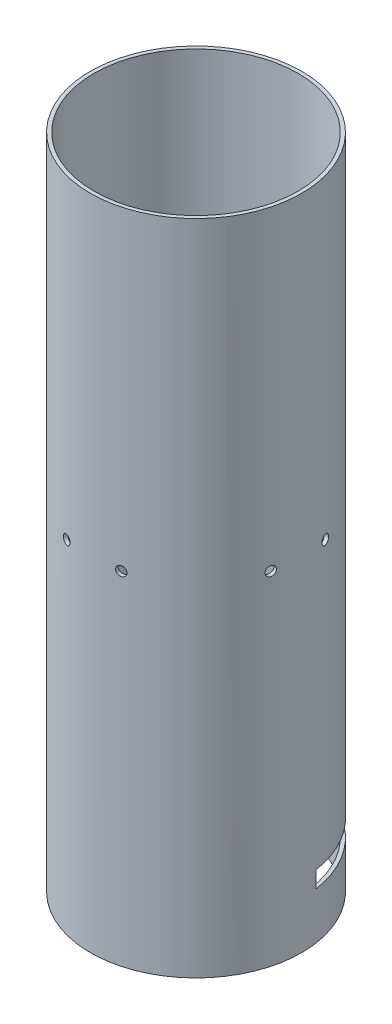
ISO-10303-21;
HEADER;
FILE_DESCRIPTION(('STEP AP214'),'2;1');
FILE_NAME('part.step','',(''),(''),'','','');
FILE_SCHEMA(('AUTOMOTIVE_DESIGN { 1 0 10303 214 1 1 1 1 }'));
ENDSEC;
DATA;
#1=APPLICATION_CONTEXT('core data for automotive mechanical design processes');
#2=APPLICATION_PROTOCOL_DEFINITION('international standard','automotive_design',2000,#1);
#3=PRODUCT_CONTEXT('',#1,'mechanical');
#4=PRODUCT('Part','Part','',(#3));
#5=PRODUCT_RELATED_PRODUCT_CATEGORY('part','',(#4));
#6=PRODUCT_DEFINITION_FORMATION('','',#4);
#7=PRODUCT_DEFINITION_CONTEXT('part definition',#1,'design');
#8=PRODUCT_DEFINITION('design','',#6,#7);
#9=PRODUCT_DEFINITION_SHAPE('','',#8);
#10=(LENGTH_UNIT() NAMED_UNIT(*) SI_UNIT(.MILLI.,.METRE.));
#11=(NAMED_UNIT(*) PLANE_ANGLE_UNIT() SI_UNIT($,.RADIAN.));
#12=(NAMED_UNIT(*) SI_UNIT($,.STERADIAN.) SOLID_ANGLE_UNIT());
#13=UNCERTAINTY_MEASURE_WITH_UNIT(LENGTH_MEASURE(1.E-05),#10,'distance_accuracy_value','');
#14=(GEOMETRIC_REPRESENTATION_CONTEXT(3) GLOBAL_UNCERTAINTY_ASSIGNED_CONTEXT((#13)) GLOBAL_UNIT_ASSIGNED_CONTEXT((#10,
#11,#12)) REPRESENTATION_CONTEXT('',''));
#15=CARTESIAN_POINT('',(0.,0.,0.));
#16=DIRECTION('',(0.,0.,1.));
#17=DIRECTION('',(1.,0.,0.));
#18=AXIS2_PLACEMENT_3D('',#15,#16,#17);
#19=CARTESIAN_POINT('',(0.,304.8,0.));
#20=DIRECTION('',(0.,-1.,0.));
#21=DIRECTION('',(0.,0.,-1.));
#22=AXIS2_PLACEMENT_3D('',#19,#20,#21);
#23=CYLINDRICAL_SURFACE('',#22,44.704);
#24=CARTESIAN_POINT('',(0.,26.615,0.));
#25=DIRECTION('',(0.,-1.,0.));
#26=DIRECTION('',(0.,0.,-1.));
#27=AXIS2_PLACEMENT_3D('',#24,#25,#26);
#28=CIRCLE('',#27,44.704);
#29=CARTESIAN_POINT('',(0.,26.615,-44.704));
#30=VERTEX_POINT('',#29);
#31=EDGE_CURVE('E116',#30,#30,#28,.T.);
#32=ORIENTED_EDGE('',*,*,#31,.F.);
#33=EDGE_LOOP('',(#32));
#34=FACE_BOUND('',#33,.T.);
#35=CARTESIAN_POINT('',(-13.4905132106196,171.425591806,-42.6198741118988));
#36=CARTESIAN_POINT('',(-13.4905085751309,171.53787235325,-42.6198759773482));
#37=CARTESIAN_POINT('',(-13.4814602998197,171.650232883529,-42.6227429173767));
#38=CARTESIAN_POINT('',(-13.4454836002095,171.871855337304,-42.6341052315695));
#39=CARTESIAN_POINT('',(-13.4185340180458,171.981113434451,-42.6426072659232));
#40=CARTESIAN_POINT('',(-13.347499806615,172.193288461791,-42.6648947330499));
#41=CARTESIAN_POINT('',(-13.3034238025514,172.29620855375,-42.67867750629));
#42=CARTESIAN_POINT('',(-13.1993593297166,172.492814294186,-42.7109761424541));
#43=CARTESIAN_POINT('',(-13.1393746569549,172.58650213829,-42.7294908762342));
#44=CARTESIAN_POINT('',(-13.0050875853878,172.762090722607,-42.7705533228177));
#45=CARTESIAN_POINT('',(-12.930774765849,172.843982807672,-42.793103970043));
#46=CARTESIAN_POINT('',(-12.7699053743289,172.993581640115,-42.84138385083));
#47=CARTESIAN_POINT('',(-12.6833483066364,173.061287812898,-42.8671132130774));
#48=CARTESIAN_POINT('',(-12.5003527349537,173.18061489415,-42.9208327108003));
#49=CARTESIAN_POINT('',(-12.4039102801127,173.232229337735,-42.9488237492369));
#50=CARTESIAN_POINT('',(-12.2038635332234,173.317866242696,-43.0060942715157));
#51=CARTESIAN_POINT('',(-12.1002592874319,173.351888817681,-43.0353737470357));
#52=CARTESIAN_POINT('',(-11.8888721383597,173.401354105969,-43.094249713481));
#53=CARTESIAN_POINT('',(-11.7810921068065,173.416809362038,-43.1238459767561));
#54=CARTESIAN_POINT('',(-11.5643360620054,173.428739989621,-43.1824773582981));
#55=CARTESIAN_POINT('',(-11.4553600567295,173.425215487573,-43.2115124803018));
#56=CARTESIAN_POINT('',(-11.239391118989,173.399297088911,-43.2681887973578));
#57=CARTESIAN_POINT('',(-11.1323968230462,173.376916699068,-43.2958309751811));
#58=CARTESIAN_POINT('',(-10.923367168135,173.313942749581,-43.34904041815));
#59=CARTESIAN_POINT('',(-10.8213318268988,173.273349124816,-43.3746076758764));
#60=CARTESIAN_POINT('',(-10.6251115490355,173.175085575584,-43.423091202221));
#61=CARTESIAN_POINT('',(-10.5309294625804,173.117409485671,-43.4460065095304));
#62=CARTESIAN_POINT('',(-10.3531697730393,172.986622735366,-43.4887095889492));
#63=CARTESIAN_POINT('',(-10.2695922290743,172.91351198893,-43.5084973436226));
#64=CARTESIAN_POINT('',(-10.1153922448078,172.753854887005,-43.5446064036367));
#65=CARTESIAN_POINT('',(-10.0447812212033,172.667296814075,-43.5609246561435));
#66=CARTESIAN_POINT('',(-9.91866202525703,172.483243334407,-43.5898148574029));
#67=CARTESIAN_POINT('',(-9.86315385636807,172.385747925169,-43.602386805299));
#68=CARTESIAN_POINT('',(-9.76886570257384,172.182580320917,-43.6236085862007));
#69=CARTESIAN_POINT('',(-9.73008613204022,172.076907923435,-43.6322583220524));
#70=CARTESIAN_POINT('',(-9.6704003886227,171.860389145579,-43.6455257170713));
#71=CARTESIAN_POINT('',(-9.64949410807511,171.749542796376,-43.6501434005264));
#72=CARTESIAN_POINT('',(-9.62618345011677,171.525925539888,-43.6552900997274));
#73=CARTESIAN_POINT('',(-9.62376304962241,171.413156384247,-43.6558226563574));
#74=CARTESIAN_POINT('',(-9.63745350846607,171.188804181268,-43.6528023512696));
#75=CARTESIAN_POINT('',(-9.65356431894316,171.077221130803,-43.6492495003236));
#76=CARTESIAN_POINT('',(-9.70383046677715,170.858454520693,-43.6381019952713));
#77=CARTESIAN_POINT('',(-9.73797849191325,170.751269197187,-43.630508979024));
#78=CARTESIAN_POINT('',(-9.82330951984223,170.544286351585,-43.6113758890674));
#79=CARTESIAN_POINT('',(-9.87449260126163,170.444488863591,-43.59983579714));
#80=CARTESIAN_POINT('',(-9.99243615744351,170.255039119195,-43.5729558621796));
#81=CARTESIAN_POINT('',(-10.0592073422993,170.165393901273,-43.557613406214));
#82=CARTESIAN_POINT('',(-10.2063621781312,169.998864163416,-43.5233670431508));
#83=CARTESIAN_POINT('',(-10.2867458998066,169.921979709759,-43.5044631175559));
#84=CARTESIAN_POINT('',(-10.4588569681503,169.7830989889,-43.4634069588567));
#85=CARTESIAN_POINT('',(-10.5505923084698,169.721113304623,-43.4412524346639));
#86=CARTESIAN_POINT('',(-10.7427102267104,169.613862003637,-43.394142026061));
#87=CARTESIAN_POINT('',(-10.8430927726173,169.568596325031,-43.369186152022));
#88=CARTESIAN_POINT('',(-11.0495763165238,169.496088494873,-43.3170382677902));
#89=CARTESIAN_POINT('',(-11.1556751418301,169.468839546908,-43.2898471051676));
#90=CARTESIAN_POINT('',(-11.3705850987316,169.433116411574,-43.233895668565));
#91=CARTESIAN_POINT('',(-11.4793962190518,169.424642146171,-43.2051354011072));
#92=CARTESIAN_POINT('',(-11.6965320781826,169.426709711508,-43.1468582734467));
#93=CARTESIAN_POINT('',(-11.8048571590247,169.437234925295,-43.117342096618));
#94=CARTESIAN_POINT('',(-12.0180517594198,169.476968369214,-43.0584055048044));
#95=CARTESIAN_POINT('',(-12.1229212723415,169.506176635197,-43.0289850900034));
#96=CARTESIAN_POINT('',(-12.3262595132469,169.582443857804,-42.9711778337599));
#97=CARTESIAN_POINT('',(-12.424728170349,169.629503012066,-42.9427910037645));
#98=CARTESIAN_POINT('',(-12.6125153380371,169.74013288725,-42.8880129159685));
#99=CARTESIAN_POINT('',(-12.7018341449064,169.803703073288,-42.8616215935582));
#100=CARTESIAN_POINT('',(-12.8689166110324,169.945608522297,-42.8117533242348));
#101=CARTESIAN_POINT('',(-12.9466713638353,170.023955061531,-42.7882786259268));
#102=CARTESIAN_POINT('',(-13.0884160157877,170.193187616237,-42.7451340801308));
#103=CARTESIAN_POINT('',(-13.1524025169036,170.284076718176,-42.7254651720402));
#104=CARTESIAN_POINT('',(-13.2648714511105,170.475874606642,-42.6906814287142));
#105=CARTESIAN_POINT('',(-13.3133404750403,170.576791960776,-42.6755705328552));
#106=CARTESIAN_POINT('',(-13.3933200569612,170.78564419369,-42.6505377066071));
#107=CARTESIAN_POINT('',(-13.4248507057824,170.893570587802,-42.6406096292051));
#108=CARTESIAN_POINT('',(-13.4617933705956,171.072741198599,-42.6289566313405));
#109=CARTESIAN_POINT('',(-13.4725500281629,171.142824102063,-42.6255565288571));
#110=CARTESIAN_POINT('',(-13.4869114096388,171.283791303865,-42.621014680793));
#111=CARTESIAN_POINT('',(-13.4905161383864,171.354675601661,-42.6198729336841));
#112=CARTESIAN_POINT('',(-13.4905132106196,171.425591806,-42.6198741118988));
#113=B_SPLINE_CURVE_WITH_KNOTS('',3,(#35,#36,#37,#38,#39,#40,#41,#42,#43,#44,#45,#46,#47,#48,
#49,#50,#51,#52,#53,#54,#55,#56,#57,#58,#59,#60,#61,#62,#63,#64,#65,#66,#67,#68,#69,#70,#71,#72,
#73,#74,#75,#76,#77,#78,#79,#80,#81,#82,#83,#84,#85,#86,#87,#88,#89,#90,#91,#92,#93,#94,#95,#96,
#97,#98,#99,#100,#101,#102,#103,#104,#105,#106,#107,#108,#109,#110,#111,#112),.UNSPECIFIED.,.T.,
.F.,(4,2,2,2,2,2,2,2,2,2,2,2,2,2,2,2,2,2,2,2,2,2,2,2,2,2,2,2,2,2,2,2,2,2,2,2,2,2,4),(0.,
0.336582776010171,0.673564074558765,1.01037588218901,1.34710739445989,1.68408473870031,
2.02107572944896,2.35820193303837,2.69532595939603,3.03222212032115,3.3691160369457,
3.70576883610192,4.04242283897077,4.37919849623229,4.71597603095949,5.05304868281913,
5.39012141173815,5.72720248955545,6.06428153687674,6.40106837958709,6.73785433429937,
7.07450386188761,7.41115494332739,7.7480380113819,8.08492282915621,8.42204624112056,
8.75916840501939,9.09616332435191,9.43315684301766,9.76985576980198,10.1065553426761,
10.44325864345,10.7799510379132,11.1169014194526,11.4539348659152,11.7912587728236,
12.1281816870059,12.3407669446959,12.5533520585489),.UNSPECIFIED.);
#114=CARTESIAN_POINT('',(-13.4905132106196,171.425591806,-42.6198741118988));
#115=VERTEX_POINT('',#114);
#116=EDGE_CURVE('E151',#115,#115,#113,.T.);
#117=ORIENTED_EDGE('',*,*,#116,.F.);
#118=EDGE_LOOP('',(#117));
#119=FACE_BOUND('',#118,.T.);
#120=CARTESIAN_POINT('',(13.4905132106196,171.425591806,42.6198741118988));
#121=CARTESIAN_POINT('',(13.4905085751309,171.53787235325,42.6198759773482));
#122=CARTESIAN_POINT('',(13.4814602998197,171.650232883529,42.6227429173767));
#123=CARTESIAN_POINT('',(13.4454836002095,171.871855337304,42.6341052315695));
#124=CARTESIAN_POINT('',(13.4185340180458,171.981113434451,42.6426072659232));
#125=CARTESIAN_POINT('',(13.347499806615,172.193288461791,42.6648947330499));
#126=CARTESIAN_POINT('',(13.3034238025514,172.29620855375,42.67867750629));
#127=CARTESIAN_POINT('',(13.1993593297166,172.492814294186,42.7109761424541));
#128=CARTESIAN_POINT('',(13.1393746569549,172.58650213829,42.7294908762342));
#129=CARTESIAN_POINT('',(13.0050875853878,172.762090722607,42.7705533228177));
#130=CARTESIAN_POINT('',(12.930774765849,172.843982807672,42.793103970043));
#131=CARTESIAN_POINT('',(12.7699053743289,172.993581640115,42.84138385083));
#132=CARTESIAN_POINT('',(12.6833483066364,173.061287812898,42.8671132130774));
#133=CARTESIAN_POINT('',(12.5003527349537,173.18061489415,42.9208327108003));
#134=CARTESIAN_POINT('',(12.4039102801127,173.232229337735,42.9488237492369));
#135=CARTESIAN_POINT('',(12.2038635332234,173.317866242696,43.0060942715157));
#136=CARTESIAN_POINT('',(12.1002592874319,173.351888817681,43.0353737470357));
#137=CARTESIAN_POINT('',(11.8888721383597,173.401354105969,43.094249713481));
#138=CARTESIAN_POINT('',(11.7810921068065,173.416809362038,43.1238459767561));
#139=CARTESIAN_POINT('',(11.5643360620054,173.428739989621,43.1824773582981));
#140=CARTESIAN_POINT('',(11.4553600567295,173.425215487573,43.2115124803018));
#141=CARTESIAN_POINT('',(11.239391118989,173.399297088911,43.2681887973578));
#142=CARTESIAN_POINT('',(11.1323968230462,173.376916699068,43.2958309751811));
#143=CARTESIAN_POINT('',(10.923367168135,173.313942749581,43.34904041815));
#144=CARTESIAN_POINT('',(10.8213318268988,173.273349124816,43.3746076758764));
#145=CARTESIAN_POINT('',(10.6251115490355,173.175085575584,43.423091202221));
#146=CARTESIAN_POINT('',(10.5309294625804,173.117409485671,43.4460065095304));
#147=CARTESIAN_POINT('',(10.3531697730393,172.986622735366,43.4887095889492));
#148=CARTESIAN_POINT('',(10.2695922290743,172.91351198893,43.5084973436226));
#149=CARTESIAN_POINT('',(10.1153922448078,172.753854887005,43.5446064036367));
#150=CARTESIAN_POINT('',(10.0447812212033,172.667296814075,43.5609246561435));
#151=CARTESIAN_POINT('',(9.91866202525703,172.483243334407,43.5898148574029));
#152=CARTESIAN_POINT('',(9.86315385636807,172.385747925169,43.602386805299));
#153=CARTESIAN_POINT('',(9.76886570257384,172.182580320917,43.6236085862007));
#154=CARTESIAN_POINT('',(9.73008613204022,172.076907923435,43.6322583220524));
#155=CARTESIAN_POINT('',(9.6704003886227,171.860389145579,43.6455257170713));
#156=CARTESIAN_POINT('',(9.64949410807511,171.749542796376,43.6501434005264));
#157=CARTESIAN_POINT('',(9.62618345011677,171.525925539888,43.6552900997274));
#158=CARTESIAN_POINT('',(9.62376304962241,171.413156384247,43.6558226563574));
#159=CARTESIAN_POINT('',(9.63745350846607,171.188804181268,43.6528023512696));
#160=CARTESIAN_POINT('',(9.65356431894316,171.077221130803,43.6492495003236));
#161=CARTESIAN_POINT('',(9.70383046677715,170.858454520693,43.6381019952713));
#162=CARTESIAN_POINT('',(9.73797849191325,170.751269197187,43.630508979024));
#163=CARTESIAN_POINT('',(9.82330951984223,170.544286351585,43.6113758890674));
#164=CARTESIAN_POINT('',(9.87449260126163,170.444488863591,43.59983579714));
#165=CARTESIAN_POINT('',(9.99243615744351,170.255039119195,43.5729558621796));
#166=CARTESIAN_POINT('',(10.0592073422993,170.165393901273,43.557613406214));
#167=CARTESIAN_POINT('',(10.2063621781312,169.998864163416,43.5233670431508));
#168=CARTESIAN_POINT('',(10.2867458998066,169.921979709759,43.5044631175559));
#169=CARTESIAN_POINT('',(10.4588569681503,169.7830989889,43.4634069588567));
#170=CARTESIAN_POINT('',(10.5505923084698,169.721113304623,43.4412524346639));
#171=CARTESIAN_POINT('',(10.7427102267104,169.613862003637,43.394142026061));
#172=CARTESIAN_POINT('',(10.8430927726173,169.568596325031,43.369186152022));
#173=CARTESIAN_POINT('',(11.0495763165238,169.496088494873,43.3170382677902));
#174=CARTESIAN_POINT('',(11.1556751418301,169.468839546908,43.2898471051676));
#175=CARTESIAN_POINT('',(11.3705850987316,169.433116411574,43.233895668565));
#176=CARTESIAN_POINT('',(11.4793962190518,169.424642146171,43.2051354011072));
#177=CARTESIAN_POINT('',(11.6965320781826,169.426709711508,43.1468582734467));
#178=CARTESIAN_POINT('',(11.8048571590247,169.437234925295,43.117342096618));
#179=CARTESIAN_POINT('',(12.0180517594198,169.476968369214,43.0584055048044));
#180=CARTESIAN_POINT('',(12.1229212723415,169.506176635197,43.0289850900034));
#181=CARTESIAN_POINT('',(12.3262595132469,169.582443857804,42.9711778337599));
#182=CARTESIAN_POINT('',(12.424728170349,169.629503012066,42.9427910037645));
#183=CARTESIAN_POINT('',(12.6125153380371,169.74013288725,42.8880129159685));
#184=CARTESIAN_POINT('',(12.7018341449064,169.803703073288,42.8616215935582));
#185=CARTESIAN_POINT('',(12.8689166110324,169.945608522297,42.8117533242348));
#186=CARTESIAN_POINT('',(12.9466713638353,170.023955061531,42.7882786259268));
#187=CARTESIAN_POINT('',(13.0884160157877,170.193187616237,42.7451340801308));
#188=CARTESIAN_POINT('',(13.1524025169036,170.284076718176,42.7254651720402));
#189=CARTESIAN_POINT('',(13.2648714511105,170.475874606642,42.6906814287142));
#190=CARTESIAN_POINT('',(13.3133404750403,170.576791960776,42.6755705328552));
#191=CARTESIAN_POINT('',(13.3933200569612,170.78564419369,42.6505377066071));
#192=CARTESIAN_POINT('',(13.4248507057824,170.893570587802,42.6406096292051));
#193=CARTESIAN_POINT('',(13.4617933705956,171.072741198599,42.6289566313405));
#194=CARTESIAN_POINT('',(13.4725500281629,171.142824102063,42.6255565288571));
#195=CARTESIAN_POINT('',(13.4869114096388,171.283791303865,42.621014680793));
#196=CARTESIAN_POINT('',(13.4905161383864,171.354675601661,42.6198729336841));
#197=CARTESIAN_POINT('',(13.4905132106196,171.425591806,42.6198741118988));
#198=B_SPLINE_CURVE_WITH_KNOTS('',3,(#120,#121,#122,#123,#124,#125,#126,#127,#128,#129,#130,
#131,#132,#133,#134,#135,#136,#137,#138,#139,#140,#141,#142,#143,#144,#145,#146,#147,#148,#149,
#150,#151,#152,#153,#154,#155,#156,#157,#158,#159,#160,#161,#162,#163,#164,#165,#166,#167,#168,
#169,#170,#171,#172,#173,#174,#175,#176,#177,#178,#179,#180,#181,#182,#183,#184,#185,#186,#187,
#188,#189,#190,#191,#192,#193,#194,#195,#196,#197),.UNSPECIFIED.,.T.,.F.,(4,2,2,2,2,2,2,2,2,2,2,
2,2,2,2,2,2,2,2,2,2,2,2,2,2,2,2,2,2,2,2,2,2,2,2,2,2,2,4),(0.,0.336582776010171,
0.673564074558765,1.01037588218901,1.34710739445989,1.68408473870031,2.02107572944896,
2.35820193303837,2.69532595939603,3.03222212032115,3.3691160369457,3.70576883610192,
4.04242283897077,4.37919849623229,4.71597603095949,5.05304868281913,5.39012141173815,
5.72720248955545,6.06428153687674,6.40106837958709,6.73785433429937,7.07450386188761,
7.41115494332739,7.7480380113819,8.08492282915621,8.42204624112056,8.75916840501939,
9.09616332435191,9.43315684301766,9.76985576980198,10.1065553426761,10.44325864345,
10.7799510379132,11.1169014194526,11.4539348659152,11.7912587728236,12.1281816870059,
12.3407669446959,12.5533520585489),.UNSPECIFIED.);
#199=CARTESIAN_POINT('',(13.4905132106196,171.425591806,42.6198741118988));
#200=VERTEX_POINT('',#199);
#201=EDGE_CURVE('E237',#200,#200,#198,.T.);
#202=ORIENTED_EDGE('',*,*,#201,.F.);
#203=EDGE_LOOP('',(#202));
#204=FACE_BOUND('',#203,.T.);
#205=CARTESIAN_POINT('',(-9.62680990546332,171.425591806,43.6551502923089));
#206=CARTESIAN_POINT('',(-9.62681485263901,171.31331125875,43.6551495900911));
#207=CARTESIAN_POINT('',(-9.63608435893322,171.200950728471,43.6531082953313));
#208=CARTESIAN_POINT('',(-9.67292225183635,170.979328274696,43.644959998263));
#209=CARTESIAN_POINT('',(-9.70051229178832,170.870070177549,43.6388481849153));
#210=CARTESIAN_POINT('',(-9.77317345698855,170.657895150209,43.6226325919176));
#211=CARTESIAN_POINT('',(-9.81823578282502,170.55497505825,43.6125308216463));
#212=CARTESIAN_POINT('',(-9.9245075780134,170.358369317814,43.5884700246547));
#213=CARTESIAN_POINT('',(-9.98571319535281,170.26468147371,43.5745119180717));
#214=CARTESIAN_POINT('',(-10.1225404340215,170.089092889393,43.542929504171));
#215=CARTESIAN_POINT('',(-10.1981725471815,170.007200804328,43.5253025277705));
#216=CARTESIAN_POINT('',(-10.3616294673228,169.857601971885,43.4866794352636));
#217=CARTESIAN_POINT('',(-10.4494547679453,169.789895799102,43.4656831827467));
#218=CARTESIAN_POINT('',(-10.634793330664,169.67056871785,43.4207078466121));
#219=CARTESIAN_POINT('',(-10.732310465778,169.618954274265,43.3967275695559));
#220=CARTESIAN_POINT('',(-10.9341912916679,169.533317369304,43.3463019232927));
#221=CARTESIAN_POINT('',(-11.0385549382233,169.499294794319,43.3198565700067));
#222=CARTESIAN_POINT('',(-11.2510595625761,169.449829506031,43.2651510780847));
#223=CARTESIAN_POINT('',(-11.3591979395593,169.434374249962,43.2368921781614));
#224=CARTESIAN_POINT('',(-11.5762298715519,169.422443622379,43.1792904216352));
#225=CARTESIAN_POINT('',(-11.6851234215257,169.425968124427,43.1499475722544));
#226=CARTESIAN_POINT('',(-11.9004961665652,169.451886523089,43.0910462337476));
#227=CARTESIAN_POINT('',(-12.0069770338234,169.474266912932,43.0614879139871));
#228=CARTESIAN_POINT('',(-12.2146067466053,169.537240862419,43.0030538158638));
#229=CARTESIAN_POINT('',(-12.3157555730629,169.577834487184,42.9741780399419));
#230=CARTESIAN_POINT('',(-12.5099290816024,169.676098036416,42.9180558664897));
#231=CARTESIAN_POINT('',(-12.6029508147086,169.733774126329,42.8908100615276));
#232=CARTESIAN_POINT('',(-12.7782467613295,169.864560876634,42.8389121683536));
#233=CARTESIAN_POINT('',(-12.8605209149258,169.93767162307,42.8142600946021));
#234=CARTESIAN_POINT('',(-13.0121165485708,170.097328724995,42.7684314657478));
#235=CARTESIAN_POINT('',(-13.0814266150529,170.183886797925,42.7472579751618));
#236=CARTESIAN_POINT('',(-13.2050941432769,170.367940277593,42.7092180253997));
#237=CARTESIAN_POINT('',(-13.2594516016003,170.465435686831,42.6923515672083));
#238=CARTESIAN_POINT('',(-13.3517184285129,170.668603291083,42.6635860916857));
#239=CARTESIAN_POINT('',(-13.3896273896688,170.774275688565,42.6516871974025));
#240=CARTESIAN_POINT('',(-13.4479504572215,170.990794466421,42.6333342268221));
#241=CARTESIAN_POINT('',(-13.468364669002,171.101640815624,42.6268801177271));
#242=CARTESIAN_POINT('',(-13.4911256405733,171.325258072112,42.6196819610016));
#243=CARTESIAN_POINT('',(-13.4934880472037,171.438027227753,42.618932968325));
#244=CARTESIAN_POINT('',(-13.4801216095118,171.662379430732,42.6231625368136));
#245=CARTESIAN_POINT('',(-13.4643928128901,171.773962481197,42.628141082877));
#246=CARTESIAN_POINT('',(-13.4152872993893,171.992729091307,42.6436201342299));
#247=CARTESIAN_POINT('',(-13.3819177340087,172.099914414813,42.6541184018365));
#248=CARTESIAN_POINT('',(-13.2984523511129,172.306897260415,42.6802141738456));
#249=CARTESIAN_POINT('',(-13.248356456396,172.406694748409,42.6958117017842));
#250=CARTESIAN_POINT('',(-13.1327743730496,172.596144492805,42.7315047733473));
#251=CARTESIAN_POINT('',(-13.0672776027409,172.685789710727,42.7516034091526));
#252=CARTESIAN_POINT('',(-12.9227145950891,172.852319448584,42.7955226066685));
#253=CARTESIAN_POINT('',(-12.8436482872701,172.929203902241,42.8193431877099));
#254=CARTESIAN_POINT('',(-12.6740676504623,173.0680846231,42.8698430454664));
#255=CARTESIAN_POINT('',(-12.5835452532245,173.130070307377,42.8965243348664));
#256=CARTESIAN_POINT('',(-12.3936110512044,173.237321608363,42.9517844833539));
#257=CARTESIAN_POINT('',(-12.294199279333,173.282587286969,42.980363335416));
#258=CARTESIAN_POINT('',(-12.0893053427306,173.355095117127,43.0384437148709));
#259=CARTESIAN_POINT('',(-11.9838254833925,173.382344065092,43.0679448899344));
#260=CARTESIAN_POINT('',(-11.7697322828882,173.418067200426,43.1269445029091));
#261=CARTESIAN_POINT('',(-11.6611189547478,173.426541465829,43.1564429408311));
#262=CARTESIAN_POINT('',(-11.4439352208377,173.424473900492,43.2145413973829));
#263=CARTESIAN_POINT('',(-11.335364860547,173.413948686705,43.2431421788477));
#264=CARTESIAN_POINT('',(-11.1212646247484,173.374215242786,43.2986988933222));
#265=CARTESIAN_POINT('',(-11.0157347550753,173.345006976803,43.3256548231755));
#266=CARTESIAN_POINT('',(-10.8107350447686,173.268739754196,43.3772613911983));
#267=CARTESIAN_POINT('',(-10.7112652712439,173.221680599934,43.4019120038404));
#268=CARTESIAN_POINT('',(-10.5212477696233,173.11105072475,43.4483663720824));
#269=CARTESIAN_POINT('',(-10.4306997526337,173.047480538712,43.4701702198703));
#270=CARTESIAN_POINT('',(-10.2610679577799,172.905575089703,43.5105242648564));
#271=CARTESIAN_POINT('',(-10.1819930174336,172.827228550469,43.5290719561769));
#272=CARTESIAN_POINT('',(-10.0376662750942,172.657995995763,43.562580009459));
#273=CARTESIAN_POINT('',(-9.97241788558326,172.567106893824,43.5775394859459));
#274=CARTESIAN_POINT('',(-9.85762505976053,172.375309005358,43.6036503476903));
#275=CARTESIAN_POINT('',(-9.8080942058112,172.274391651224,43.6147984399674));
#276=CARTESIAN_POINT('',(-9.72631344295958,172.06553941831,43.6331091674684));
#277=CARTESIAN_POINT('',(-9.69404306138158,171.957613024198,43.6402765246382));
#278=CARTESIAN_POINT('',(-9.65622327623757,171.778442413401,43.6486560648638));
#279=CARTESIAN_POINT('',(-9.64520768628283,171.708359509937,43.6510898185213));
#280=CARTESIAN_POINT('',(-9.63049944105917,171.567392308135,43.6543371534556));
#281=CARTESIAN_POINT('',(-9.6268067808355,171.496508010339,43.6551507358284));
#282=CARTESIAN_POINT('',(-9.62680990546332,171.425591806,43.6551502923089));
#283=B_SPLINE_CURVE_WITH_KNOTS('',3,(#205,#206,#207,#208,#209,#210,#211,#212,#213,#214,#215,
#216,#217,#218,#219,#220,#221,#222,#223,#224,#225,#226,#227,#228,#229,#230,#231,#232,#233,#234,
#235,#236,#237,#238,#239,#240,#241,#242,#243,#244,#245,#246,#247,#248,#249,#250,#251,#252,#253,
#254,#255,#256,#257,#258,#259,#260,#261,#262,#263,#264,#265,#266,#267,#268,#269,#270,#271,#272,
#273,#274,#275,#276,#277,#278,#279,#280,#281,#282),.UNSPECIFIED.,.T.,.F.,(4,2,2,2,2,2,2,2,2,2,2,
2,2,2,2,2,2,2,2,2,2,2,2,2,2,2,2,2,2,2,2,2,2,2,2,2,2,2,4),(0.,0.336582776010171,
0.673564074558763,1.01037588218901,1.34710739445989,1.68408473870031,2.02107572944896,
2.35820193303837,2.69532595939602,3.03222212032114,3.3691160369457,3.70576883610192,
4.04242283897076,4.37919849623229,4.7159760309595,5.05304868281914,5.39012141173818,
5.72720248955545,6.06428153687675,6.40106837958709,6.73785433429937,7.07450386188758,
7.4111549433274,7.7480380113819,8.08492282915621,8.42204624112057,8.7591684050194,
9.09616332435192,9.43315684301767,9.76985576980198,10.1065553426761,10.44325864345,
10.7799510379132,11.1169014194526,11.4539348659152,11.7912587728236,12.1281816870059,
12.3407669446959,12.5533520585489),.UNSPECIFIED.);
#284=CARTESIAN_POINT('',(-9.62680990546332,171.425591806,43.6551502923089));
#285=VERTEX_POINT('',#284);
#286=EDGE_CURVE('E258',#285,#285,#283,.T.);
#287=ORIENTED_EDGE('',*,*,#286,.T.);
#288=EDGE_LOOP('',(#287));
#289=FACE_BOUND('',#288,.T.);
#290=CARTESIAN_POINT('',(0.,304.8,0.));
#291=DIRECTION('',(0.,1.,0.));
#292=DIRECTION('',(0.,0.,1.));
#293=AXIS2_PLACEMENT_3D('',#290,#291,#292);
#294=CIRCLE('',#293,44.704);
#295=CARTESIAN_POINT('',(0.,304.8,44.704));
#296=VERTEX_POINT('',#295);
#297=EDGE_CURVE('E11',#296,#296,#294,.T.);
#298=ORIENTED_EDGE('',*,*,#297,.F.);
#299=EDGE_LOOP('',(#298));
#300=FACE_BOUND('',#299,.T.);
#301=CARTESIAN_POINT('',(-43.655150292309,171.425591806,-9.62680990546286));
#302=CARTESIAN_POINT('',(-43.6551495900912,171.31331125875,-9.62681485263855));
#303=CARTESIAN_POINT('',(-43.6531082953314,171.200950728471,-9.63608435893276));
#304=CARTESIAN_POINT('',(-43.6449599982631,170.979328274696,-9.67292225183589));
#305=CARTESIAN_POINT('',(-43.6388481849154,170.870070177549,-9.70051229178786));
#306=CARTESIAN_POINT('',(-43.6226325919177,170.657895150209,-9.77317345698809));
#307=CARTESIAN_POINT('',(-43.6125308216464,170.55497505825,-9.81823578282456));
#308=CARTESIAN_POINT('',(-43.5884700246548,170.358369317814,-9.92450757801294));
#309=CARTESIAN_POINT('',(-43.5745119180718,170.26468147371,-9.98571319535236));
#310=CARTESIAN_POINT('',(-43.5429295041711,170.089092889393,-10.122540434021));
#311=CARTESIAN_POINT('',(-43.5253025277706,170.007200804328,-10.1981725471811));
#312=CARTESIAN_POINT('',(-43.4866794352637,169.857601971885,-10.3616294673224));
#313=CARTESIAN_POINT('',(-43.4656831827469,169.789895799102,-10.4494547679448));
#314=CARTESIAN_POINT('',(-43.4207078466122,169.67056871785,-10.6347933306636));
#315=CARTESIAN_POINT('',(-43.396727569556,169.618954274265,-10.7323104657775));
#316=CARTESIAN_POINT('',(-43.3463019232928,169.533317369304,-10.9341912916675));
#317=CARTESIAN_POINT('',(-43.3198565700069,169.499294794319,-11.0385549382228));
#318=CARTESIAN_POINT('',(-43.2651510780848,169.449829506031,-11.2510595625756));
#319=CARTESIAN_POINT('',(-43.2368921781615,169.434374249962,-11.3591979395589));
#320=CARTESIAN_POINT('',(-43.1792904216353,169.422443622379,-11.5762298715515));
#321=CARTESIAN_POINT('',(-43.1499475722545,169.425968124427,-11.6851234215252));
#322=CARTESIAN_POINT('',(-43.0910462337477,169.451886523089,-11.9004961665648));
#323=CARTESIAN_POINT('',(-43.0614879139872,169.474266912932,-12.0069770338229));
#324=CARTESIAN_POINT('',(-43.0030538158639,169.537240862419,-12.2146067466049));
#325=CARTESIAN_POINT('',(-42.974178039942,169.577834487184,-12.3157555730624));
#326=CARTESIAN_POINT('',(-42.9180558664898,169.676098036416,-12.509929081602));
#327=CARTESIAN_POINT('',(-42.8908100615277,169.733774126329,-12.6029508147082));
#328=CARTESIAN_POINT('',(-42.8389121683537,169.864560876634,-12.7782467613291));
#329=CARTESIAN_POINT('',(-42.8142600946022,169.93767162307,-12.8605209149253));
#330=CARTESIAN_POINT('',(-42.768431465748,170.097328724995,-13.0121165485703));
#331=CARTESIAN_POINT('',(-42.7472579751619,170.183886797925,-13.0814266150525));
#332=CARTESIAN_POINT('',(-42.7092180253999,170.367940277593,-13.2050941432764));
#333=CARTESIAN_POINT('',(-42.6923515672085,170.465435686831,-13.2594516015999));
#334=CARTESIAN_POINT('',(-42.6635860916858,170.668603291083,-13.3517184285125));
#335=CARTESIAN_POINT('',(-42.6516871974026,170.774275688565,-13.3896273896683));
#336=CARTESIAN_POINT('',(-42.6333342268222,170.990794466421,-13.4479504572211));
#337=CARTESIAN_POINT('',(-42.6268801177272,171.101640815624,-13.4683646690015));
#338=CARTESIAN_POINT('',(-42.6196819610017,171.325258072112,-13.4911256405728));
#339=CARTESIAN_POINT('',(-42.6189329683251,171.438027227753,-13.4934880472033));
#340=CARTESIAN_POINT('',(-42.6231625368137,171.662379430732,-13.4801216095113));
#341=CARTESIAN_POINT('',(-42.6281410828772,171.773962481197,-13.4643928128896));
#342=CARTESIAN_POINT('',(-42.6436201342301,171.992729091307,-13.4152872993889));
#343=CARTESIAN_POINT('',(-42.6541184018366,172.099914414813,-13.3819177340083));
#344=CARTESIAN_POINT('',(-42.6802141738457,172.306897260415,-13.2984523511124));
#345=CARTESIAN_POINT('',(-42.6958117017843,172.406694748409,-13.2483564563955));
#346=CARTESIAN_POINT('',(-42.7315047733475,172.596144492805,-13.1327743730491));
#347=CARTESIAN_POINT('',(-42.7516034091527,172.685789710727,-13.0672776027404));
#348=CARTESIAN_POINT('',(-42.7955226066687,172.852319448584,-12.9227145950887));
#349=CARTESIAN_POINT('',(-42.81934318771,172.929203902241,-12.8436482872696));
#350=CARTESIAN_POINT('',(-42.8698430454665,173.0680846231,-12.6740676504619));
#351=CARTESIAN_POINT('',(-42.8965243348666,173.130070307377,-12.583545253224));
#352=CARTESIAN_POINT('',(-42.951784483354,173.237321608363,-12.393611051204));
#353=CARTESIAN_POINT('',(-42.9803633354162,173.282587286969,-12.2941992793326));
#354=CARTESIAN_POINT('',(-43.038443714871,173.355095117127,-12.0893053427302));
#355=CARTESIAN_POINT('',(-43.0679448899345,173.382344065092,-11.983825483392));
#356=CARTESIAN_POINT('',(-43.1269445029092,173.418067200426,-11.7697322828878));
#357=CARTESIAN_POINT('',(-43.1564429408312,173.426541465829,-11.6611189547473));
#358=CARTESIAN_POINT('',(-43.214541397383,173.424473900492,-11.4439352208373));
#359=CARTESIAN_POINT('',(-43.2431421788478,173.413948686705,-11.3353648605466));
#360=CARTESIAN_POINT('',(-43.2986988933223,173.374215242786,-11.121264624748));
#361=CARTESIAN_POINT('',(-43.3256548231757,173.345006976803,-11.0157347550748));
#362=CARTESIAN_POINT('',(-43.3772613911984,173.268739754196,-10.8107350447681));
#363=CARTESIAN_POINT('',(-43.4019120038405,173.221680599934,-10.7112652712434));
#364=CARTESIAN_POINT('',(-43.4483663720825,173.11105072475,-10.5212477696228));
#365=CARTESIAN_POINT('',(-43.4701702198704,173.047480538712,-10.4306997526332));
#366=CARTESIAN_POINT('',(-43.5105242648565,172.905575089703,-10.2610679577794));
#367=CARTESIAN_POINT('',(-43.529071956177,172.827228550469,-10.1819930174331));
#368=CARTESIAN_POINT('',(-43.5625800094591,172.657995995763,-10.0376662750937));
#369=CARTESIAN_POINT('',(-43.577539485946,172.567106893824,-9.9724178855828));
#370=CARTESIAN_POINT('',(-43.6036503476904,172.375309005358,-9.85762505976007));
#371=CARTESIAN_POINT('',(-43.6147984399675,172.274391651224,-9.80809420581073));
#372=CARTESIAN_POINT('',(-43.6331091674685,172.06553941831,-9.72631344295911));
#373=CARTESIAN_POINT('',(-43.6402765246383,171.957613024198,-9.69404306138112));
#374=CARTESIAN_POINT('',(-43.6486560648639,171.778442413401,-9.65622327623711));
#375=CARTESIAN_POINT('',(-43.6510898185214,171.708359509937,-9.64520768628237));
#376=CARTESIAN_POINT('',(-43.6543371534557,171.567392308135,-9.63049944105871));
#377=CARTESIAN_POINT('',(-43.6551507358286,171.496508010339,-9.62680678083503));
#378=CARTESIAN_POINT('',(-43.655150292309,171.425591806,-9.62680990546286));
#379=B_SPLINE_CURVE_WITH_KNOTS('',3,(#301,#302,#303,#304,#305,#306,#307,#308,#309,#310,#311,
#312,#313,#314,#315,#316,#317,#318,#319,#320,#321,#322,#323,#324,#325,#326,#327,#328,#329,#330,
#331,#332,#333,#334,#335,#336,#337,#338,#339,#340,#341,#342,#343,#344,#345,#346,#347,#348,#349,
#350,#351,#352,#353,#354,#355,#356,#357,#358,#359,#360,#361,#362,#363,#364,#365,#366,#367,#368,
#369,#370,#371,#372,#373,#374,#375,#376,#377,#378),.UNSPECIFIED.,.T.,.F.,(4,2,2,2,2,2,2,2,2,2,2,
2,2,2,2,2,2,2,2,2,2,2,2,2,2,2,2,2,2,2,2,2,2,2,2,2,2,2,4),(0.,0.336582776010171,
0.673564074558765,1.01037588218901,1.3471073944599,1.68408473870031,2.02107572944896,
2.35820193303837,2.69532595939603,3.03222212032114,3.3691160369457,3.70576883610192,
4.04242283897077,4.37919849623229,4.71597603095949,5.05304868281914,5.39012141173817,
5.72720248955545,6.06428153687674,6.40106837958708,6.73785433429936,7.0745038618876,
7.41115494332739,7.74803801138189,8.0849228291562,8.42204624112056,8.75916840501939,
9.09616332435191,9.43315684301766,9.76985576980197,10.1065553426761,10.44325864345,
10.7799510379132,11.1169014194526,11.4539348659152,11.7912587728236,12.1281816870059,
12.3407669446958,12.5533520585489),.UNSPECIFIED.);
#380=CARTESIAN_POINT('',(-43.655150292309,171.425591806,-9.62680990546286));
#381=VERTEX_POINT('',#380);
#382=EDGE_CURVE('E186',#381,#381,#379,.T.);
#383=ORIENTED_EDGE('',*,*,#382,.T.);
#384=EDGE_LOOP('',(#383));
#385=FACE_BOUND('',#384,.T.);
#386=CARTESIAN_POINT('',(9.62680990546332,171.425591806,-43.6551502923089));
#387=CARTESIAN_POINT('',(9.62681485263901,171.31331125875,-43.6551495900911));
#388=CARTESIAN_POINT('',(9.63608435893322,171.200950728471,-43.6531082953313));
#389=CARTESIAN_POINT('',(9.67292225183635,170.979328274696,-43.644959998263));
#390=CARTESIAN_POINT('',(9.70051229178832,170.870070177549,-43.6388481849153));
#391=CARTESIAN_POINT('',(9.77317345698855,170.657895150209,-43.6226325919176));
#392=CARTESIAN_POINT('',(9.81823578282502,170.55497505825,-43.6125308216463));
#393=CARTESIAN_POINT('',(9.9245075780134,170.358369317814,-43.5884700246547));
#394=CARTESIAN_POINT('',(9.98571319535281,170.26468147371,-43.5745119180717));
#395=CARTESIAN_POINT('',(10.1225404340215,170.089092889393,-43.542929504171));
#396=CARTESIAN_POINT('',(10.1981725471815,170.007200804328,-43.5253025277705));
#397=CARTESIAN_POINT('',(10.3616294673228,169.857601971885,-43.4866794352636));
#398=CARTESIAN_POINT('',(10.4494547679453,169.789895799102,-43.4656831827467));
#399=CARTESIAN_POINT('',(10.634793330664,169.67056871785,-43.4207078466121));
#400=CARTESIAN_POINT('',(10.732310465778,169.618954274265,-43.3967275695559));
#401=CARTESIAN_POINT('',(10.9341912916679,169.533317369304,-43.3463019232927));
#402=CARTESIAN_POINT('',(11.0385549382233,169.499294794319,-43.3198565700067));
#403=CARTESIAN_POINT('',(11.2510595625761,169.449829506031,-43.2651510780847));
#404=CARTESIAN_POINT('',(11.3591979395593,169.434374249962,-43.2368921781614));
#405=CARTESIAN_POINT('',(11.5762298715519,169.422443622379,-43.1792904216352));
#406=CARTESIAN_POINT('',(11.6851234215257,169.425968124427,-43.1499475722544));
#407=CARTESIAN_POINT('',(11.9004961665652,169.451886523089,-43.0910462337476));
#408=CARTESIAN_POINT('',(12.0069770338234,169.474266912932,-43.0614879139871));
#409=CARTESIAN_POINT('',(12.2146067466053,169.537240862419,-43.0030538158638));
#410=CARTESIAN_POINT('',(12.3157555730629,169.577834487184,-42.9741780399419));
#411=CARTESIAN_POINT('',(12.5099290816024,169.676098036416,-42.9180558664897));
#412=CARTESIAN_POINT('',(12.6029508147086,169.733774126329,-42.8908100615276));
#413=CARTESIAN_POINT('',(12.7782467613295,169.864560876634,-42.8389121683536));
#414=CARTESIAN_POINT('',(12.8605209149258,169.93767162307,-42.8142600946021));
#415=CARTESIAN_POINT('',(13.0121165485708,170.097328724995,-42.7684314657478));
#416=CARTESIAN_POINT('',(13.0814266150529,170.183886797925,-42.7472579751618));
#417=CARTESIAN_POINT('',(13.2050941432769,170.367940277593,-42.7092180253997));
#418=CARTESIAN_POINT('',(13.2594516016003,170.465435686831,-42.6923515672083));
#419=CARTESIAN_POINT('',(13.3517184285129,170.668603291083,-42.6635860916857));
#420=CARTESIAN_POINT('',(13.3896273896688,170.774275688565,-42.6516871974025));
#421=CARTESIAN_POINT('',(13.4479504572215,170.990794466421,-42.6333342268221));
#422=CARTESIAN_POINT('',(13.468364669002,171.101640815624,-42.6268801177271));
#423=CARTESIAN_POINT('',(13.4911256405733,171.325258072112,-42.6196819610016));
#424=CARTESIAN_POINT('',(13.4934880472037,171.438027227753,-42.618932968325));
#425=CARTESIAN_POINT('',(13.4801216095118,171.662379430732,-42.6231625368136));
#426=CARTESIAN_POINT('',(13.4643928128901,171.773962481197,-42.628141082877));
#427=CARTESIAN_POINT('',(13.4152872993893,171.992729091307,-42.6436201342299));
#428=CARTESIAN_POINT('',(13.3819177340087,172.099914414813,-42.6541184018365));
#429=CARTESIAN_POINT('',(13.2984523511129,172.306897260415,-42.6802141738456));
#430=CARTESIAN_POINT('',(13.248356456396,172.406694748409,-42.6958117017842));
#431=CARTESIAN_POINT('',(13.1327743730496,172.596144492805,-42.7315047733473));
#432=CARTESIAN_POINT('',(13.0672776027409,172.685789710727,-42.7516034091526));
#433=CARTESIAN_POINT('',(12.9227145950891,172.852319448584,-42.7955226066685));
#434=CARTESIAN_POINT('',(12.8436482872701,172.929203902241,-42.8193431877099));
#435=CARTESIAN_POINT('',(12.6740676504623,173.0680846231,-42.8698430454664));
#436=CARTESIAN_POINT('',(12.5835452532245,173.130070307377,-42.8965243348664));
#437=CARTESIAN_POINT('',(12.3936110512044,173.237321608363,-42.9517844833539));
#438=CARTESIAN_POINT('',(12.294199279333,173.282587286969,-42.980363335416));
#439=CARTESIAN_POINT('',(12.0893053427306,173.355095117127,-43.0384437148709));
#440=CARTESIAN_POINT('',(11.9838254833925,173.382344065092,-43.0679448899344));
#441=CARTESIAN_POINT('',(11.7697322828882,173.418067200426,-43.1269445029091));
#442=CARTESIAN_POINT('',(11.6611189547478,173.426541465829,-43.1564429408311));
#443=CARTESIAN_POINT('',(11.4439352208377,173.424473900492,-43.2145413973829));
#444=CARTESIAN_POINT('',(11.335364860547,173.413948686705,-43.2431421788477));
#445=CARTESIAN_POINT('',(11.1212646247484,173.374215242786,-43.2986988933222));
#446=CARTESIAN_POINT('',(11.0157347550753,173.345006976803,-43.3256548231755));
#447=CARTESIAN_POINT('',(10.8107350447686,173.268739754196,-43.3772613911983));
#448=CARTESIAN_POINT('',(10.7112652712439,173.221680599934,-43.4019120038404));
#449=CARTESIAN_POINT('',(10.5212477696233,173.11105072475,-43.4483663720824));
#450=CARTESIAN_POINT('',(10.4306997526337,173.047480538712,-43.4701702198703));
#451=CARTESIAN_POINT('',(10.2610679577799,172.905575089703,-43.5105242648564));
#452=CARTESIAN_POINT('',(10.1819930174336,172.827228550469,-43.5290719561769));
#453=CARTESIAN_POINT('',(10.0376662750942,172.657995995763,-43.562580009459));
#454=CARTESIAN_POINT('',(9.97241788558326,172.567106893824,-43.5775394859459));
#455=CARTESIAN_POINT('',(9.85762505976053,172.375309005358,-43.6036503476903));
#456=CARTESIAN_POINT('',(9.8080942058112,172.274391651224,-43.6147984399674));
#457=CARTESIAN_POINT('',(9.72631344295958,172.06553941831,-43.6331091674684));
#458=CARTESIAN_POINT('',(9.69404306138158,171.957613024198,-43.6402765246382));
#459=CARTESIAN_POINT('',(9.65622327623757,171.778442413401,-43.6486560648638));
#460=CARTESIAN_POINT('',(9.64520768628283,171.708359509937,-43.6510898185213));
#461=CARTESIAN_POINT('',(9.63049944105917,171.567392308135,-43.6543371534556));
#462=CARTESIAN_POINT('',(9.6268067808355,171.496508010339,-43.6551507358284));
#463=CARTESIAN_POINT('',(9.62680990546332,171.425591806,-43.6551502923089));
#464=B_SPLINE_CURVE_WITH_KNOTS('',3,(#386,#387,#388,#389,#390,#391,#392,#393,#394,#395,#396,
#397,#398,#399,#400,#401,#402,#403,#404,#405,#406,#407,#408,#409,#410,#411,#412,#413,#414,#415,
#416,#417,#418,#419,#420,#421,#422,#423,#424,#425,#426,#427,#428,#429,#430,#431,#432,#433,#434,
#435,#436,#437,#438,#439,#440,#441,#442,#443,#444,#445,#446,#447,#448,#449,#450,#451,#452,#453,
#454,#455,#456,#457,#458,#459,#460,#461,#462,#463),.UNSPECIFIED.,.T.,.F.,(4,2,2,2,2,2,2,2,2,2,2,
2,2,2,2,2,2,2,2,2,2,2,2,2,2,2,2,2,2,2,2,2,2,2,2,2,2,2,4),(0.,0.336582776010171,
0.673564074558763,1.01037588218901,1.34710739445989,1.68408473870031,2.02107572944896,
2.35820193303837,2.69532595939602,3.03222212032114,3.3691160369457,3.70576883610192,
4.04242283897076,4.37919849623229,4.7159760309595,5.05304868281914,5.39012141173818,
5.72720248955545,6.06428153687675,6.40106837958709,6.73785433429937,7.07450386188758,
7.4111549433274,7.7480380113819,8.08492282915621,8.42204624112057,8.7591684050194,
9.09616332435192,9.43315684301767,9.76985576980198,10.1065553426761,10.44325864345,
10.7799510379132,11.1169014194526,11.4539348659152,11.7912587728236,12.1281816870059,
12.3407669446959,12.5533520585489),.UNSPECIFIED.);
#465=CARTESIAN_POINT('',(9.62680990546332,171.425591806,-43.6551502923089));
#466=VERTEX_POINT('',#465);
#467=EDGE_CURVE('E219',#466,#466,#464,.T.);
#468=ORIENTED_EDGE('',*,*,#467,.T.);
#469=EDGE_LOOP('',(#468));
#470=FACE_BOUND('',#469,.T.);
#471=CARTESIAN_POINT('',(43.6551502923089,171.425591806,9.62680990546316));
#472=CARTESIAN_POINT('',(43.6551495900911,171.31331125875,9.62681485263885));
#473=CARTESIAN_POINT('',(43.6531082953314,171.200950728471,9.63608435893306));
#474=CARTESIAN_POINT('',(43.644959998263,170.979328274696,9.67292225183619));
#475=CARTESIAN_POINT('',(43.6388481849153,170.870070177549,9.70051229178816));
#476=CARTESIAN_POINT('',(43.6226325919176,170.657895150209,9.77317345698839));
#477=CARTESIAN_POINT('',(43.6125308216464,170.55497505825,9.81823578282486));
#478=CARTESIAN_POINT('',(43.5884700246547,170.358369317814,9.92450757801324));
#479=CARTESIAN_POINT('',(43.5745119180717,170.26468147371,9.98571319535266));
#480=CARTESIAN_POINT('',(43.542929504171,170.089092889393,10.1225404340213));
#481=CARTESIAN_POINT('',(43.5253025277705,170.007200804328,10.1981725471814));
#482=CARTESIAN_POINT('',(43.4866794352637,169.857601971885,10.3616294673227));
#483=CARTESIAN_POINT('',(43.4656831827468,169.789895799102,10.4494547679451));
#484=CARTESIAN_POINT('',(43.4207078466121,169.67056871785,10.6347933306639));
#485=CARTESIAN_POINT('',(43.3967275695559,169.618954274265,10.7323104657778));
#486=CARTESIAN_POINT('',(43.3463019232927,169.533317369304,10.9341912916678));
#487=CARTESIAN_POINT('',(43.3198565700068,169.499294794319,11.0385549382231));
#488=CARTESIAN_POINT('',(43.2651510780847,169.449829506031,11.2510595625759));
#489=CARTESIAN_POINT('',(43.2368921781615,169.434374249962,11.3591979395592));
#490=CARTESIAN_POINT('',(43.1792904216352,169.422443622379,11.5762298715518));
#491=CARTESIAN_POINT('',(43.1499475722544,169.425968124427,11.6851234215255));
#492=CARTESIAN_POINT('',(43.0910462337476,169.451886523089,11.9004961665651));
#493=CARTESIAN_POINT('',(43.0614879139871,169.474266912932,12.0069770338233));
#494=CARTESIAN_POINT('',(43.0030538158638,169.537240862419,12.2146067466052));
#495=CARTESIAN_POINT('',(42.9741780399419,169.577834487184,12.3157555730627));
#496=CARTESIAN_POINT('',(42.9180558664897,169.676098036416,12.5099290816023));
#497=CARTESIAN_POINT('',(42.8908100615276,169.733774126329,12.6029508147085));
#498=CARTESIAN_POINT('',(42.8389121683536,169.864560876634,12.7782467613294));
#499=CARTESIAN_POINT('',(42.8142600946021,169.93767162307,12.8605209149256));
#500=CARTESIAN_POINT('',(42.7684314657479,170.097328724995,13.0121165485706));
#501=CARTESIAN_POINT('',(42.7472579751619,170.183886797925,13.0814266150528));
#502=CARTESIAN_POINT('',(42.7092180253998,170.367940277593,13.2050941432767));
#503=CARTESIAN_POINT('',(42.6923515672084,170.465435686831,13.2594516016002));
#504=CARTESIAN_POINT('',(42.6635860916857,170.668603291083,13.3517184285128));
#505=CARTESIAN_POINT('',(42.6516871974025,170.774275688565,13.3896273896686));
#506=CARTESIAN_POINT('',(42.6333342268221,170.990794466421,13.4479504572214));
#507=CARTESIAN_POINT('',(42.6268801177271,171.101640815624,13.4683646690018));
#508=CARTESIAN_POINT('',(42.6196819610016,171.325258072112,13.4911256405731));
#509=CARTESIAN_POINT('',(42.618932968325,171.438027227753,13.4934880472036));
#510=CARTESIAN_POINT('',(42.6231625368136,171.662379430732,13.4801216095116));
#511=CARTESIAN_POINT('',(42.6281410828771,171.773962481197,13.4643928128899));
#512=CARTESIAN_POINT('',(42.64362013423,171.992729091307,13.4152872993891));
#513=CARTESIAN_POINT('',(42.6541184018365,172.099914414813,13.3819177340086));
#514=CARTESIAN_POINT('',(42.6802141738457,172.306897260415,13.2984523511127));
#515=CARTESIAN_POINT('',(42.6958117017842,172.406694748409,13.2483564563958));
#516=CARTESIAN_POINT('',(42.7315047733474,172.596144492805,13.1327743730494));
#517=CARTESIAN_POINT('',(42.7516034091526,172.685789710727,13.0672776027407));
#518=CARTESIAN_POINT('',(42.7955226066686,172.852319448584,12.922714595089));
#519=CARTESIAN_POINT('',(42.8193431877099,172.929203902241,12.8436482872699));
#520=CARTESIAN_POINT('',(42.8698430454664,173.0680846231,12.6740676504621));
#521=CARTESIAN_POINT('',(42.8965243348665,173.130070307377,12.5835452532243));
#522=CARTESIAN_POINT('',(42.951784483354,173.237321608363,12.3936110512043));
#523=CARTESIAN_POINT('',(42.9803633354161,173.282587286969,12.2941992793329));
#524=CARTESIAN_POINT('',(43.0384437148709,173.355095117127,12.0893053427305));
#525=CARTESIAN_POINT('',(43.0679448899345,173.382344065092,11.9838254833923));
#526=CARTESIAN_POINT('',(43.1269445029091,173.418067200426,11.7697322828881));
#527=CARTESIAN_POINT('',(43.1564429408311,173.426541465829,11.6611189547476));
#528=CARTESIAN_POINT('',(43.214541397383,173.424473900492,11.4439352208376));
#529=CARTESIAN_POINT('',(43.2431421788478,173.413948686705,11.3353648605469));
#530=CARTESIAN_POINT('',(43.2986988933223,173.374215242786,11.1212646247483));
#531=CARTESIAN_POINT('',(43.3256548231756,173.345006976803,11.0157347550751));
#532=CARTESIAN_POINT('',(43.3772613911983,173.268739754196,10.8107350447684));
#533=CARTESIAN_POINT('',(43.4019120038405,173.221680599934,10.7112652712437));
#534=CARTESIAN_POINT('',(43.4483663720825,173.11105072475,10.5212477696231));
#535=CARTESIAN_POINT('',(43.4701702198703,173.047480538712,10.4306997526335));
#536=CARTESIAN_POINT('',(43.5105242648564,172.905575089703,10.2610679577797));
#537=CARTESIAN_POINT('',(43.529071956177,172.827228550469,10.1819930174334));
#538=CARTESIAN_POINT('',(43.5625800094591,172.657995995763,10.037666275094));
#539=CARTESIAN_POINT('',(43.5775394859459,172.567106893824,9.9724178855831));
#540=CARTESIAN_POINT('',(43.6036503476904,172.375309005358,9.85762505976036));
#541=CARTESIAN_POINT('',(43.6147984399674,172.274391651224,9.80809420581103));
#542=CARTESIAN_POINT('',(43.6331091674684,172.06553941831,9.72631344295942));
#543=CARTESIAN_POINT('',(43.6402765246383,171.957613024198,9.69404306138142));
#544=CARTESIAN_POINT('',(43.6486560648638,171.778442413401,9.65622327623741));
#545=CARTESIAN_POINT('',(43.6510898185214,171.708359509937,9.64520768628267));
#546=CARTESIAN_POINT('',(43.6543371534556,171.567392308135,9.63049944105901));
#547=CARTESIAN_POINT('',(43.6551507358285,171.496508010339,9.62680678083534));
#548=CARTESIAN_POINT('',(43.6551502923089,171.425591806,9.62680990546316));
#549=B_SPLINE_CURVE_WITH_KNOTS('',3,(#471,#472,#473,#474,#475,#476,#477,#478,#479,#480,#481,
#482,#483,#484,#485,#486,#487,#488,#489,#490,#491,#492,#493,#494,#495,#496,#497,#498,#499,#500,
#501,#502,#503,#504,#505,#506,#507,#508,#509,#510,#511,#512,#513,#514,#515,#516,#517,#518,#519,
#520,#521,#522,#523,#524,#525,#526,#527,#528,#529,#530,#531,#532,#533,#534,#535,#536,#537,#538,
#539,#540,#541,#542,#543,#544,#545,#546,#547,#548),.UNSPECIFIED.,.T.,.F.,(4,2,2,2,2,2,2,2,2,2,2,
2,2,2,2,2,2,2,2,2,2,2,2,2,2,2,2,2,2,2,2,2,2,2,2,2,2,2,4),(0.,0.336582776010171,
0.673564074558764,1.01037588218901,1.34710739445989,1.68408473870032,2.02107572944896,
2.35820193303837,2.69532595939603,3.03222212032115,3.3691160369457,3.70576883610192,
4.04242283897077,4.37919849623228,4.71597603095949,5.05304868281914,5.39012141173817,
5.72720248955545,6.06428153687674,6.40106837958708,6.73785433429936,7.0745038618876,
7.41115494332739,7.74803801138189,8.0849228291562,8.42204624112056,8.75916840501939,
9.09616332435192,9.43315684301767,9.76985576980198,10.1065553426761,10.44325864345,
10.7799510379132,11.1169014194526,11.4539348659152,11.7912587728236,12.1281816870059,
12.3407669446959,12.5533520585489),.UNSPECIFIED.);
#550=CARTESIAN_POINT('',(43.6551502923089,171.425591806,9.62680990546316));
#551=VERTEX_POINT('',#550);
#552=EDGE_CURVE('E225',#551,#551,#549,.T.);
#553=ORIENTED_EDGE('',*,*,#552,.T.);
#554=EDGE_LOOP('',(#553));
#555=FACE_BOUND('',#554,.T.);
#556=CARTESIAN_POINT('',(42.6198741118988,171.425591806,-13.4905132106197));
#557=CARTESIAN_POINT('',(42.6198759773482,171.53787235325,-13.490508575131));
#558=CARTESIAN_POINT('',(42.6227429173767,171.650232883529,-13.4814602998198));
#559=CARTESIAN_POINT('',(42.6341052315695,171.871855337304,-13.4454836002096));
#560=CARTESIAN_POINT('',(42.6426072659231,171.981113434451,-13.4185340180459));
#561=CARTESIAN_POINT('',(42.6648947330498,172.193288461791,-13.3474998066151));
#562=CARTESIAN_POINT('',(42.67867750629,172.29620855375,-13.3034238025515));
#563=CARTESIAN_POINT('',(42.7109761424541,172.492814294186,-13.1993593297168));
#564=CARTESIAN_POINT('',(42.7294908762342,172.58650213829,-13.139374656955));
#565=CARTESIAN_POINT('',(42.7705533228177,172.762090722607,-13.0050875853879));
#566=CARTESIAN_POINT('',(42.793103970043,172.843982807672,-12.9307747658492));
#567=CARTESIAN_POINT('',(42.84138385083,172.993581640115,-12.769905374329));
#568=CARTESIAN_POINT('',(42.8671132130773,173.061287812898,-12.6833483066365));
#569=CARTESIAN_POINT('',(42.9208327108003,173.18061489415,-12.5003527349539));
#570=CARTESIAN_POINT('',(42.9488237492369,173.232229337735,-12.4039102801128));
#571=CARTESIAN_POINT('',(43.0060942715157,173.317866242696,-12.2038635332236));
#572=CARTESIAN_POINT('',(43.0353737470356,173.351888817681,-12.1002592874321));
#573=CARTESIAN_POINT('',(43.094249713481,173.401354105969,-11.8888721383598));
#574=CARTESIAN_POINT('',(43.1238459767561,173.416809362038,-11.7810921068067));
#575=CARTESIAN_POINT('',(43.182477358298,173.428739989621,-11.5643360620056));
#576=CARTESIAN_POINT('',(43.2115124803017,173.425215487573,-11.4553600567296));
#577=CARTESIAN_POINT('',(43.2681887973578,173.399297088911,-11.2393911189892));
#578=CARTESIAN_POINT('',(43.295830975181,173.376916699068,-11.1323968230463));
#579=CARTESIAN_POINT('',(43.34904041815,173.313942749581,-10.9233671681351));
#580=CARTESIAN_POINT('',(43.3746076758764,173.273349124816,-10.8213318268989));
#581=CARTESIAN_POINT('',(43.4230912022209,173.175085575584,-10.6251115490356));
#582=CARTESIAN_POINT('',(43.4460065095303,173.117409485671,-10.5309294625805));
#583=CARTESIAN_POINT('',(43.4887095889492,172.986622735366,-10.3531697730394));
#584=CARTESIAN_POINT('',(43.5084973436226,172.91351198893,-10.2695922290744));
#585=CARTESIAN_POINT('',(43.5446064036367,172.753854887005,-10.1153922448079));
#586=CARTESIAN_POINT('',(43.5609246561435,172.667296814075,-10.0447812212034));
#587=CARTESIAN_POINT('',(43.5898148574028,172.483243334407,-9.91866202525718));
#588=CARTESIAN_POINT('',(43.6023868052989,172.385747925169,-9.86315385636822));
#589=CARTESIAN_POINT('',(43.6236085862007,172.182580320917,-9.76886570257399));
#590=CARTESIAN_POINT('',(43.6322583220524,172.076907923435,-9.73008613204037));
#591=CARTESIAN_POINT('',(43.6455257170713,171.860389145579,-9.67040038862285));
#592=CARTESIAN_POINT('',(43.6501434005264,171.749542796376,-9.64949410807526));
#593=CARTESIAN_POINT('',(43.6552900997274,171.525925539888,-9.62618345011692));
#594=CARTESIAN_POINT('',(43.6558226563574,171.413156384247,-9.62376304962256));
#595=CARTESIAN_POINT('',(43.6528023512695,171.188804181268,-9.63745350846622));
#596=CARTESIAN_POINT('',(43.6492495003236,171.077221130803,-9.65356431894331));
#597=CARTESIAN_POINT('',(43.6381019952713,170.858454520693,-9.7038304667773));
#598=CARTESIAN_POINT('',(43.630508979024,170.751269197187,-9.7379784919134));
#599=CARTESIAN_POINT('',(43.6113758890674,170.544286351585,-9.82330951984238));
#600=CARTESIAN_POINT('',(43.59983579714,170.444488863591,-9.87449260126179));
#601=CARTESIAN_POINT('',(43.5729558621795,170.255039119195,-9.99243615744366));
#602=CARTESIAN_POINT('',(43.5576134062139,170.165393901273,-10.0592073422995));
#603=CARTESIAN_POINT('',(43.5233670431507,169.998864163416,-10.2063621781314));
#604=CARTESIAN_POINT('',(43.5044631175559,169.921979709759,-10.2867458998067));
#605=CARTESIAN_POINT('',(43.4634069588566,169.7830989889,-10.4588569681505));
#606=CARTESIAN_POINT('',(43.4412524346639,169.721113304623,-10.55059230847));
#607=CARTESIAN_POINT('',(43.3941420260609,169.613862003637,-10.7427102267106));
#608=CARTESIAN_POINT('',(43.369186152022,169.568596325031,-10.8430927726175));
#609=CARTESIAN_POINT('',(43.3170382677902,169.496088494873,-11.049576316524));
#610=CARTESIAN_POINT('',(43.2898471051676,169.468839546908,-11.1556751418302));
#611=CARTESIAN_POINT('',(43.233895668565,169.433116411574,-11.3705850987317));
#612=CARTESIAN_POINT('',(43.2051354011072,169.424642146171,-11.4793962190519));
#613=CARTESIAN_POINT('',(43.1468582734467,169.426709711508,-11.6965320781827));
#614=CARTESIAN_POINT('',(43.1173420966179,169.437234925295,-11.8048571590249));
#615=CARTESIAN_POINT('',(43.0584055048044,169.476968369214,-12.01805175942));
#616=CARTESIAN_POINT('',(43.0289850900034,169.506176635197,-12.1229212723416));
#617=CARTESIAN_POINT('',(42.9711778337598,169.582443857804,-12.3262595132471));
#618=CARTESIAN_POINT('',(42.9427910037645,169.629503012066,-12.4247281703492));
#619=CARTESIAN_POINT('',(42.8880129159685,169.74013288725,-12.6125153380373));
#620=CARTESIAN_POINT('',(42.8616215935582,169.803703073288,-12.7018341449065));
#621=CARTESIAN_POINT('',(42.8117533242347,169.945608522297,-12.8689166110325));
#622=CARTESIAN_POINT('',(42.7882786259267,170.023955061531,-12.9466713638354));
#623=CARTESIAN_POINT('',(42.7451340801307,170.193187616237,-13.0884160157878));
#624=CARTESIAN_POINT('',(42.7254651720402,170.284076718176,-13.1524025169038));
#625=CARTESIAN_POINT('',(42.6906814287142,170.475874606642,-13.2648714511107));
#626=CARTESIAN_POINT('',(42.6755705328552,170.576791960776,-13.3133404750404));
#627=CARTESIAN_POINT('',(42.650537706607,170.78564419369,-13.3933200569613));
#628=CARTESIAN_POINT('',(42.6406096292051,170.893570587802,-13.4248507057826));
#629=CARTESIAN_POINT('',(42.6289566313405,171.072741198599,-13.4617933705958));
#630=CARTESIAN_POINT('',(42.6255565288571,171.142824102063,-13.472550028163));
#631=CARTESIAN_POINT('',(42.6210146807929,171.283791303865,-13.4869114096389));
#632=CARTESIAN_POINT('',(42.6198729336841,171.354675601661,-13.4905161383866));
#633=CARTESIAN_POINT('',(42.6198741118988,171.425591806,-13.4905132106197));
#634=B_SPLINE_CURVE_WITH_KNOTS('',3,(#556,#557,#558,#559,#560,#561,#562,#563,#564,#565,#566,
#567,#568,#569,#570,#571,#572,#573,#574,#575,#576,#577,#578,#579,#580,#581,#582,#583,#584,#585,
#586,#587,#588,#589,#590,#591,#592,#593,#594,#595,#596,#597,#598,#599,#600,#601,#602,#603,#604,
#605,#606,#607,#608,#609,#610,#611,#612,#613,#614,#615,#616,#617,#618,#619,#620,#621,#622,#623,
#624,#625,#626,#627,#628,#629,#630,#631,#632,#633),.UNSPECIFIED.,.T.,.F.,(4,2,2,2,2,2,2,2,2,2,2,
2,2,2,2,2,2,2,2,2,2,2,2,2,2,2,2,2,2,2,2,2,2,2,2,2,2,2,4),(0.,0.336582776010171,
0.673564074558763,1.01037588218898,1.34710739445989,1.68408473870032,2.02107572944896,
2.35820193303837,2.69532595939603,3.03222212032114,3.3691160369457,3.70576883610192,
4.04242283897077,4.37919849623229,4.71597603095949,5.05304868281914,5.39012141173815,
5.72720248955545,6.06428153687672,6.40106837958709,6.73785433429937,7.07450386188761,
7.41115494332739,7.7480380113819,8.08492282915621,8.42204624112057,8.75916840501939,
9.09616332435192,9.43315684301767,9.76985576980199,10.1065553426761,10.44325864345,
10.7799510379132,11.1169014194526,11.4539348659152,11.7912587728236,12.1281816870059,
12.3407669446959,12.5533520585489),.UNSPECIFIED.);
#635=CARTESIAN_POINT('',(42.6198741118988,171.425591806,-13.4905132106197));
#636=VERTEX_POINT('',#635);
#637=EDGE_CURVE('E164',#636,#636,#634,.T.);
#638=ORIENTED_EDGE('',*,*,#637,.F.);
#639=EDGE_LOOP('',(#638));
#640=FACE_BOUND('',#639,.T.);
#641=CARTESIAN_POINT('',(-42.6198741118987,171.425591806,13.49051321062));
#642=CARTESIAN_POINT('',(-42.6198759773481,171.53787235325,13.4905085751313));
#643=CARTESIAN_POINT('',(-42.6227429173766,171.650232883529,13.4814602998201));
#644=CARTESIAN_POINT('',(-42.6341052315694,171.871855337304,13.4454836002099));
#645=CARTESIAN_POINT('',(-42.642607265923,171.981113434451,13.4185340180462));
#646=CARTESIAN_POINT('',(-42.6648947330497,172.193288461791,13.3474998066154));
#647=CARTESIAN_POINT('',(-42.6786775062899,172.29620855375,13.3034238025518));
#648=CARTESIAN_POINT('',(-42.710976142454,172.492814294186,13.199359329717));
#649=CARTESIAN_POINT('',(-42.7294908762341,172.58650213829,13.1393746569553));
#650=CARTESIAN_POINT('',(-42.7705533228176,172.762090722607,13.0050875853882));
#651=CARTESIAN_POINT('',(-42.7931039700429,172.843982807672,12.9307747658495));
#652=CARTESIAN_POINT('',(-42.8413838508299,172.993581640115,12.7699053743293));
#653=CARTESIAN_POINT('',(-42.8671132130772,173.061287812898,12.6833483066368));
#654=CARTESIAN_POINT('',(-42.9208327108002,173.18061489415,12.5003527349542));
#655=CARTESIAN_POINT('',(-42.9488237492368,173.232229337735,12.4039102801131));
#656=CARTESIAN_POINT('',(-43.0060942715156,173.317866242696,12.2038635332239));
#657=CARTESIAN_POINT('',(-43.0353737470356,173.351888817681,12.1002592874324));
#658=CARTESIAN_POINT('',(-43.0942497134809,173.401354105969,11.8888721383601));
#659=CARTESIAN_POINT('',(-43.123845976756,173.416809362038,11.781092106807));
#660=CARTESIAN_POINT('',(-43.182477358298,173.428739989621,11.5643360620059));
#661=CARTESIAN_POINT('',(-43.2115124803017,173.425215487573,11.4553600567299));
#662=CARTESIAN_POINT('',(-43.2681887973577,173.399297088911,11.2393911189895));
#663=CARTESIAN_POINT('',(-43.2958309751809,173.376916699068,11.1323968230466));
#664=CARTESIAN_POINT('',(-43.3490404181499,173.313942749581,10.9233671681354));
#665=CARTESIAN_POINT('',(-43.3746076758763,173.273349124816,10.8213318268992));
#666=CARTESIAN_POINT('',(-43.4230912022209,173.175085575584,10.6251115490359));
#667=CARTESIAN_POINT('',(-43.4460065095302,173.117409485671,10.5309294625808));
#668=CARTESIAN_POINT('',(-43.4887095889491,172.986622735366,10.3531697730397));
#669=CARTESIAN_POINT('',(-43.5084973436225,172.91351198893,10.2695922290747));
#670=CARTESIAN_POINT('',(-43.5446064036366,172.753854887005,10.1153922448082));
#671=CARTESIAN_POINT('',(-43.5609246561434,172.667296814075,10.0447812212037));
#672=CARTESIAN_POINT('',(-43.5898148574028,172.483243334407,9.91866202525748));
#673=CARTESIAN_POINT('',(-43.6023868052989,172.385747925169,9.86315385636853));
#674=CARTESIAN_POINT('',(-43.6236085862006,172.182580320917,9.7688657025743));
#675=CARTESIAN_POINT('',(-43.6322583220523,172.076907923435,9.73008613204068));
#676=CARTESIAN_POINT('',(-43.6455257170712,171.860389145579,9.67040038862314));
#677=CARTESIAN_POINT('',(-43.6501434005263,171.749542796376,9.64949410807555));
#678=CARTESIAN_POINT('',(-43.6552900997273,171.525925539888,9.62618345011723));
#679=CARTESIAN_POINT('',(-43.6558226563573,171.413156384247,9.62376304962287));
#680=CARTESIAN_POINT('',(-43.6528023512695,171.188804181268,9.63745350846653));
#681=CARTESIAN_POINT('',(-43.6492495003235,171.077221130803,9.65356431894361));
#682=CARTESIAN_POINT('',(-43.6381019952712,170.858454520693,9.7038304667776));
#683=CARTESIAN_POINT('',(-43.6305089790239,170.751269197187,9.73797849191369));
#684=CARTESIAN_POINT('',(-43.6113758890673,170.544286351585,9.82330951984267));
#685=CARTESIAN_POINT('',(-43.5998357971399,170.444488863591,9.87449260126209));
#686=CARTESIAN_POINT('',(-43.5729558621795,170.255039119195,9.99243615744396));
#687=CARTESIAN_POINT('',(-43.5576134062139,170.165393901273,10.0592073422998));
#688=CARTESIAN_POINT('',(-43.5233670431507,169.998864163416,10.2063621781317));
#689=CARTESIAN_POINT('',(-43.5044631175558,169.921979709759,10.286745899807));
#690=CARTESIAN_POINT('',(-43.4634069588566,169.7830989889,10.4588569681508));
#691=CARTESIAN_POINT('',(-43.4412524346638,169.721113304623,10.5505923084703));
#692=CARTESIAN_POINT('',(-43.3941420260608,169.613862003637,10.7427102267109));
#693=CARTESIAN_POINT('',(-43.3691861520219,169.568596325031,10.8430927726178));
#694=CARTESIAN_POINT('',(-43.3170382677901,169.496088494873,11.0495763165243));
#695=CARTESIAN_POINT('',(-43.2898471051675,169.468839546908,11.1556751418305));
#696=CARTESIAN_POINT('',(-43.2338956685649,169.433116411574,11.370585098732));
#697=CARTESIAN_POINT('',(-43.2051354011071,169.424642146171,11.4793962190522));
#698=CARTESIAN_POINT('',(-43.1468582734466,169.426709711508,11.696532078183));
#699=CARTESIAN_POINT('',(-43.1173420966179,169.437234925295,11.8048571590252));
#700=CARTESIAN_POINT('',(-43.0584055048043,169.476968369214,12.0180517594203));
#701=CARTESIAN_POINT('',(-43.0289850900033,169.506176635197,12.1229212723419));
#702=CARTESIAN_POINT('',(-42.9711778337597,169.582443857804,12.3262595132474));
#703=CARTESIAN_POINT('',(-42.9427910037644,169.629503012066,12.4247281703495));
#704=CARTESIAN_POINT('',(-42.8880129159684,169.74013288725,12.6125153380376));
#705=CARTESIAN_POINT('',(-42.8616215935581,169.803703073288,12.7018341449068));
#706=CARTESIAN_POINT('',(-42.8117533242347,169.945608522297,12.8689166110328));
#707=CARTESIAN_POINT('',(-42.7882786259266,170.023955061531,12.9466713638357));
#708=CARTESIAN_POINT('',(-42.7451340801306,170.193187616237,13.0884160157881));
#709=CARTESIAN_POINT('',(-42.7254651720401,170.284076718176,13.152402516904));
#710=CARTESIAN_POINT('',(-42.6906814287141,170.475874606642,13.264871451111));
#711=CARTESIAN_POINT('',(-42.6755705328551,170.576791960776,13.3133404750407));
#712=CARTESIAN_POINT('',(-42.6505377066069,170.78564419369,13.3933200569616));
#713=CARTESIAN_POINT('',(-42.640609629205,170.893570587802,13.4248507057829));
#714=CARTESIAN_POINT('',(-42.6289566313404,171.072741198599,13.4617933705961));
#715=CARTESIAN_POINT('',(-42.625556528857,171.142824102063,13.4725500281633));
#716=CARTESIAN_POINT('',(-42.6210146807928,171.283791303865,13.4869114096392));
#717=CARTESIAN_POINT('',(-42.619872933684,171.354675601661,13.4905161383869));
#718=CARTESIAN_POINT('',(-42.6198741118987,171.425591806,13.49051321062));
#719=B_SPLINE_CURVE_WITH_KNOTS('',3,(#641,#642,#643,#644,#645,#646,#647,#648,#649,#650,#651,
#652,#653,#654,#655,#656,#657,#658,#659,#660,#661,#662,#663,#664,#665,#666,#667,#668,#669,#670,
#671,#672,#673,#674,#675,#676,#677,#678,#679,#680,#681,#682,#683,#684,#685,#686,#687,#688,#689,
#690,#691,#692,#693,#694,#695,#696,#697,#698,#699,#700,#701,#702,#703,#704,#705,#706,#707,#708,
#709,#710,#711,#712,#713,#714,#715,#716,#717,#718),.UNSPECIFIED.,.T.,.F.,(4,2,2,2,2,2,2,2,2,2,2,
2,2,2,2,2,2,2,2,2,2,2,2,2,2,2,2,2,2,2,2,2,2,2,2,2,2,2,4),(0.,0.336582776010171,
0.673564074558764,1.01037588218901,1.34710739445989,1.68408473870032,2.02107572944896,
2.35820193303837,2.69532595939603,3.03222212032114,3.3691160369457,3.70576883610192,
4.04242283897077,4.37919849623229,4.71597603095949,5.05304868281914,5.39012141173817,
5.72720248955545,6.06428153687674,6.40106837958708,6.73785433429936,7.0745038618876,
7.41115494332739,7.74803801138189,8.0849228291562,8.42204624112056,8.75916840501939,
9.09616332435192,9.43315684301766,9.76985576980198,10.1065553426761,10.44325864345,
10.7799510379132,11.1169014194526,11.4539348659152,11.7912587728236,12.1281816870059,
12.3407669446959,12.5533520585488),.UNSPECIFIED.);
#720=CARTESIAN_POINT('',(-42.6198741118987,171.425591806,13.49051321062));
#721=VERTEX_POINT('',#720);
#722=EDGE_CURVE('E127',#721,#721,#719,.T.);
#723=ORIENTED_EDGE('',*,*,#722,.F.);
#724=EDGE_LOOP('',(#723));
#725=FACE_BOUND('',#724,.T.);
#726=CARTESIAN_POINT('',(0.,46.4905,0.));
#727=DIRECTION('',(0.,1.,0.));
#728=DIRECTION('',(0.,0.,1.));
#729=AXIS2_PLACEMENT_3D('',#726,#727,#728);
#730=CIRCLE('',#729,44.704);
#731=CARTESIAN_POINT('',(44.2274037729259,46.4905,-6.51032806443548));
#732=VERTEX_POINT('',#731);
#733=CARTESIAN_POINT('',(6.51032806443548,46.4905,-44.2274037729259));
#734=VERTEX_POINT('',#733);
#735=EDGE_CURVE('E114',#732,#734,#730,.T.);
#736=ORIENTED_EDGE('',*,*,#735,.F.);
#737=DIRECTION('',(0.,-1.,0.));
#738=VECTOR('',#737,1.);
#739=CARTESIAN_POINT('',(44.2274037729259,304.8,-6.51032806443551));
#740=LINE('',#739,#738);
#741=CARTESIAN_POINT('',(44.2274037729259,53.4755,-6.51032806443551));
#742=VERTEX_POINT('',#741);
#743=EDGE_CURVE('E109',#742,#732,#740,.T.);
#744=ORIENTED_EDGE('',*,*,#743,.F.);
#745=CARTESIAN_POINT('',(0.,53.4755000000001,0.));
#746=DIRECTION('',(0.,-1.,0.));
#747=DIRECTION('',(1.,0.,0.));
#748=AXIS2_PLACEMENT_3D('',#745,#746,#747);
#749=CIRCLE('',#748,44.704);
#750=CARTESIAN_POINT('',(6.5103280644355,53.4755000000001,-44.2274037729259));
#751=VERTEX_POINT('',#750);
#752=EDGE_CURVE('E55',#751,#742,#749,.T.);
#753=ORIENTED_EDGE('',*,*,#752,.F.);
#754=DIRECTION('',(0.,-1.,0.));
#755=VECTOR('',#754,1.);
#756=CARTESIAN_POINT('',(6.51032806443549,304.8,-44.2274037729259));
#757=LINE('',#756,#755);
#758=EDGE_CURVE('E89',#734,#751,#757,.F.);
#759=ORIENTED_EDGE('',*,*,#758,.F.);
#760=EDGE_LOOP('',(#736,#744,#753,#759));
#761=FACE_BOUND('',#760,.T.);
#762=ADVANCED_FACE('F39',(#34,#119,#204,#289,#300,#385,#470,#555,#640,#725,#761),#23,.T.);
#763=CARTESIAN_POINT('',(0.,304.8,0.));
#764=DIRECTION('',(0.,-1.,0.));
#765=DIRECTION('',(0.,0.,-1.));
#766=AXIS2_PLACEMENT_3D('',#763,#764,#765);
#767=CYLINDRICAL_SURFACE('',#766,43.18);
#768=CARTESIAN_POINT('',(-41.1462755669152,171.425591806,13.095663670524));
#769=CARTESIAN_POINT('',(-41.1462774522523,171.313315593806,13.0956590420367));
#770=CARTESIAN_POINT('',(-41.1491587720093,171.200959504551,13.0866153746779));
#771=CARTESIAN_POINT('',(-41.1605769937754,170.979346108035,13.0506568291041));
#772=CARTESIAN_POINT('',(-41.1691205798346,170.870092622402,13.0237208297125));
#773=CARTESIAN_POINT('',(-41.191513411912,170.657926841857,12.9527217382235));
#774=CARTESIAN_POINT('',(-41.2053599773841,170.555011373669,12.9086672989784));
#775=CARTESIAN_POINT('',(-41.2378011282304,170.35841396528,12.8046519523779));
#776=CARTESIAN_POINT('',(-41.2563945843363,170.264729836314,12.7446948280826));
#777=CARTESIAN_POINT('',(-41.2976214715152,170.089143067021,12.6104630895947));
#778=CARTESIAN_POINT('',(-41.3202580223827,170.007249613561,12.5361774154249));
#779=CARTESIAN_POINT('',(-41.368706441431,169.857647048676,12.3753611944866));
#780=CARTESIAN_POINT('',(-41.3945184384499,169.78993851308,12.2888301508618));
#781=CARTESIAN_POINT('',(-41.4483915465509,169.670603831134,12.1058796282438));
#782=CARTESIAN_POINT('',(-41.4764536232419,169.61898463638,12.0094558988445));
#783=CARTESIAN_POINT('',(-41.5338458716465,169.53333859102,11.8094394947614));
#784=CARTESIAN_POINT('',(-41.5631760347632,169.499311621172,11.7058468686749));
#785=CARTESIAN_POINT('',(-41.6221258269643,169.449839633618,11.4944797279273));
#786=CARTESIAN_POINT('',(-41.6517452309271,169.434381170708,11.3867082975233));
#787=CARTESIAN_POINT('',(-41.7103940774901,169.422443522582,11.1699610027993));
#788=CARTESIAN_POINT('',(-41.7394235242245,169.425964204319,11.060985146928));
#789=CARTESIAN_POINT('',(-41.7960587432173,169.451873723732,10.8450140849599));
#790=CARTESIAN_POINT('',(-41.8236655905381,169.47424808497,10.7380174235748));
#791=CARTESIAN_POINT('',(-41.8767801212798,169.537207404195,10.5289754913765));
#792=CARTESIAN_POINT('',(-41.90228779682,169.577792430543,10.426930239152));
#793=CARTESIAN_POINT('',(-41.9506351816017,169.676037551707,10.2306811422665));
#794=CARTESIAN_POINT('',(-41.9734738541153,169.733704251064,10.1364803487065));
#795=CARTESIAN_POINT('',(-42.0160146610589,169.864470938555,9.95867874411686));
#796=CARTESIAN_POINT('',(-42.0357167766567,169.937571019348,9.87507799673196));
#797=CARTESIAN_POINT('',(-42.0716563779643,170.097211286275,9.72082415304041));
#798=CARTESIAN_POINT('',(-42.0878905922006,170.183764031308,9.65018329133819));
#799=CARTESIAN_POINT('',(-42.1166227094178,170.367808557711,9.52400612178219));
#800=CARTESIAN_POINT('',(-42.1291206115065,170.465300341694,9.46846981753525));
#801=CARTESIAN_POINT('',(-42.1502128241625,170.668463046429,9.37412967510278));
#802=CARTESIAN_POINT('',(-42.158807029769,170.774134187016,9.33532628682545));
#803=CARTESIAN_POINT('',(-42.1719882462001,170.990652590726,9.27559975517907));
#804=CARTESIAN_POINT('',(-42.1765752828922,171.101499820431,9.25467649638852));
#805=CARTESIAN_POINT('',(-42.1816890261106,171.325113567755,9.23134099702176));
#806=CARTESIAN_POINT('',(-42.1822195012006,171.437878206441,9.22891157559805));
#807=CARTESIAN_POINT('',(-42.1792243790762,171.662222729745,9.24259043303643));
#808=CARTESIAN_POINT('',(-42.1756987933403,171.773802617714,9.25869865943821));
#809=CARTESIAN_POINT('',(-42.1646324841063,171.99256101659,9.30896462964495));
#810=CARTESIAN_POINT('',(-42.1570935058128,172.099741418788,9.34311452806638));
#811=CARTESIAN_POINT('',(-42.1380894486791,172.306716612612,9.42845255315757));
#812=CARTESIAN_POINT('',(-42.1266243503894,172.406511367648,9.47964076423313));
#813=CARTESIAN_POINT('',(-42.0999066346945,172.595963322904,9.59759903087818));
#814=CARTESIAN_POINT('',(-42.0846512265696,172.685612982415,9.66438056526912));
#815=CARTESIAN_POINT('',(-42.050581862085,172.852154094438,9.81155723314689));
#816=CARTESIAN_POINT('',(-42.0317678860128,172.929045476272,9.89195244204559));
#817=CARTESIAN_POINT('',(-41.9908835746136,173.067946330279,10.0640902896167));
#818=CARTESIAN_POINT('',(-41.9688107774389,173.129944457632,10.1558414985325));
#819=CARTESIAN_POINT('',(-41.9218472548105,173.237221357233,10.3479897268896));
#820=CARTESIAN_POINT('',(-41.8969565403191,173.282500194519,10.4483867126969));
#821=CARTESIAN_POINT('',(-41.8449157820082,173.355033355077,10.6548931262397));
#822=CARTESIAN_POINT('',(-41.8177666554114,173.382294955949,10.7610002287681));
#823=CARTESIAN_POINT('',(-41.7618709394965,173.418043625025,10.9759218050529));
#824=CARTESIAN_POINT('',(-41.7331243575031,173.426530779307,11.0847362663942));
#825=CARTESIAN_POINT('',(-41.6748466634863,173.424488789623,11.3018662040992));
#826=CARTESIAN_POINT('',(-41.6453163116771,173.413977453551,11.4101820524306));
#827=CARTESIAN_POINT('',(-41.5863234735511,173.374273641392,11.6233530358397));
#828=CARTESIAN_POINT('',(-41.5568609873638,173.345081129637,11.7282081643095));
#829=CARTESIAN_POINT('',(-41.4989464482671,173.268847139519,11.9315139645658));
#830=CARTESIAN_POINT('',(-41.4704944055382,173.221805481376,12.0299645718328));
#831=CARTESIAN_POINT('',(-41.4155698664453,173.11121191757,12.2177146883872));
#832=CARTESIAN_POINT('',(-41.38909730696,173.047660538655,12.3070144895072));
#833=CARTESIAN_POINT('',(-41.3390577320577,172.905788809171,12.4740662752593));
#834=CARTESIAN_POINT('',(-41.3154931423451,172.82745626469,12.5518086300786));
#835=CARTESIAN_POINT('',(-41.272171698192,172.65824965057,12.6935318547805));
#836=CARTESIAN_POINT('',(-41.252415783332,172.567372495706,12.7575093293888));
#837=CARTESIAN_POINT('',(-41.2174698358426,172.375592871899,12.8699674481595));
#838=CARTESIAN_POINT('',(-41.2022838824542,172.274681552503,12.9184342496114));
#839=CARTESIAN_POINT('',(-41.1771218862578,172.06583750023,12.9984155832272));
#840=CARTESIAN_POINT('',(-41.1671396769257,171.957913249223,13.0299501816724));
#841=CARTESIAN_POINT('',(-41.1554170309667,171.778695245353,13.066914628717));
#842=CARTESIAN_POINT('',(-41.1519949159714,171.708562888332,13.0776822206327));
#843=CARTESIAN_POINT('',(-41.1474235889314,171.567494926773,13.0920582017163));
#844=CARTESIAN_POINT('',(-41.1462743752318,171.496559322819,13.095666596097));
#845=CARTESIAN_POINT('',(-41.1462755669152,171.425591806,13.095663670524));
#846=B_SPLINE_CURVE_WITH_KNOTS('',3,(#768,#769,#770,#771,#772,#773,#774,#775,#776,#777,#778,
#779,#780,#781,#782,#783,#784,#785,#786,#787,#788,#789,#790,#791,#792,#793,#794,#795,#796,#797,
#798,#799,#800,#801,#802,#803,#804,#805,#806,#807,#808,#809,#810,#811,#812,#813,#814,#815,#816,
#817,#818,#819,#820,#821,#822,#823,#824,#825,#826,#827,#828,#829,#830,#831,#832,#833,#834,#835,
#836,#837,#838,#839,#840,#841,#842,#843,#844,#845),.UNSPECIFIED.,.T.,.F.,(4,2,2,2,2,2,2,2,2,2,2,
2,2,2,2,2,2,2,2,2,2,2,2,2,2,2,2,2,2,2,2,2,2,2,2,2,2,2,4),(0.,0.336569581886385,
0.673537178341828,1.01033466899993,1.3470521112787,1.68403050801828,2.02102258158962,
2.35816005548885,2.6952952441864,3.03218617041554,3.36907473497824,3.70570486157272,
4.04233625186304,4.3790979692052,4.71586170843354,5.05294174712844,5.39002186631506,
5.72711104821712,6.06419805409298,6.40097186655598,6.73774472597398,7.07437126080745,
7.41099946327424,7.74787625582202,8.08475491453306,8.42188937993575,8.75902253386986,
9.09601942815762,9.43301477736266,9.76969441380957,10.1063746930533,10.4430583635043,
10.7797312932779,11.1166831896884,11.4537181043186,11.7910529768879,12.1279871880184,
12.3407261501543,12.5534649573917),.UNSPECIFIED.);
#847=CARTESIAN_POINT('',(-41.1462755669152,171.425591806,13.095663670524));
#848=VERTEX_POINT('',#847);
#849=EDGE_CURVE('E119',#848,#848,#846,.T.);
#850=ORIENTED_EDGE('',*,*,#849,.F.);
#851=EDGE_LOOP('',(#850));
#852=FACE_BOUND('',#851,.T.);
#853=CARTESIAN_POINT('',(41.1462755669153,171.425591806,-13.0956636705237));
#854=CARTESIAN_POINT('',(41.1462774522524,171.313315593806,-13.0956590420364));
#855=CARTESIAN_POINT('',(41.1491587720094,171.200959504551,-13.0866153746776));
#856=CARTESIAN_POINT('',(41.1605769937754,170.979346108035,-13.0506568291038));
#857=CARTESIAN_POINT('',(41.1691205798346,170.870092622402,-13.0237208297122));
#858=CARTESIAN_POINT('',(41.1915134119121,170.657926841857,-12.9527217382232));
#859=CARTESIAN_POINT('',(41.2053599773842,170.555011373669,-12.9086672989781));
#860=CARTESIAN_POINT('',(41.2378011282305,170.35841396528,-12.8046519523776));
#861=CARTESIAN_POINT('',(41.2563945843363,170.264729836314,-12.7446948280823));
#862=CARTESIAN_POINT('',(41.2976214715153,170.089143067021,-12.6104630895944));
#863=CARTESIAN_POINT('',(41.3202580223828,170.007249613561,-12.5361774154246));
#864=CARTESIAN_POINT('',(41.368706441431,169.857647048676,-12.3753611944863));
#865=CARTESIAN_POINT('',(41.39451843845,169.78993851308,-12.2888301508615));
#866=CARTESIAN_POINT('',(41.448391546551,169.670603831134,-12.1058796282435));
#867=CARTESIAN_POINT('',(41.476453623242,169.61898463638,-12.0094558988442));
#868=CARTESIAN_POINT('',(41.5338458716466,169.53333859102,-11.8094394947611));
#869=CARTESIAN_POINT('',(41.5631760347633,169.499311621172,-11.7058468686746));
#870=CARTESIAN_POINT('',(41.6221258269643,169.449839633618,-11.494479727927));
#871=CARTESIAN_POINT('',(41.6517452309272,169.434381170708,-11.386708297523));
#872=CARTESIAN_POINT('',(41.7103940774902,169.422443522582,-11.169961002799));
#873=CARTESIAN_POINT('',(41.7394235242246,169.425964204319,-11.0609851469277));
#874=CARTESIAN_POINT('',(41.7960587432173,169.451873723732,-10.8450140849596));
#875=CARTESIAN_POINT('',(41.8236655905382,169.47424808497,-10.7380174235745));
#876=CARTESIAN_POINT('',(41.8767801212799,169.537207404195,-10.5289754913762));
#877=CARTESIAN_POINT('',(41.90228779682,169.577792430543,-10.4269302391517));
#878=CARTESIAN_POINT('',(41.9506351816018,169.676037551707,-10.2306811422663));
#879=CARTESIAN_POINT('',(41.9734738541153,169.733704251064,-10.1364803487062));
#880=CARTESIAN_POINT('',(42.016014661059,169.864470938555,-9.95867874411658));
#881=CARTESIAN_POINT('',(42.0357167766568,169.937571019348,-9.87507799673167));
#882=CARTESIAN_POINT('',(42.0716563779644,170.097211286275,-9.72082415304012));
#883=CARTESIAN_POINT('',(42.0878905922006,170.183764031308,-9.65018329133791));
#884=CARTESIAN_POINT('',(42.1166227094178,170.367808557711,-9.52400612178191));
#885=CARTESIAN_POINT('',(42.1291206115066,170.465300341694,-9.46846981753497));
#886=CARTESIAN_POINT('',(42.1502128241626,170.668463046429,-9.3741296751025));
#887=CARTESIAN_POINT('',(42.158807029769,170.774134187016,-9.33532628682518));
#888=CARTESIAN_POINT('',(42.1719882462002,170.990652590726,-9.27559975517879));
#889=CARTESIAN_POINT('',(42.1765752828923,171.101499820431,-9.25467649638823));
#890=CARTESIAN_POINT('',(42.1816890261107,171.325113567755,-9.23134099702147));
#891=CARTESIAN_POINT('',(42.1822195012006,171.437878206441,-9.22891157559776));
#892=CARTESIAN_POINT('',(42.1792243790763,171.662222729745,-9.24259043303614));
#893=CARTESIAN_POINT('',(42.1756987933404,171.773802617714,-9.25869865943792));
#894=CARTESIAN_POINT('',(42.1646324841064,171.99256101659,-9.30896462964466));
#895=CARTESIAN_POINT('',(42.1570935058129,172.099741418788,-9.3431145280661));
#896=CARTESIAN_POINT('',(42.1380894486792,172.306716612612,-9.42845255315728));
#897=CARTESIAN_POINT('',(42.1266243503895,172.406511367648,-9.47964076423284));
#898=CARTESIAN_POINT('',(42.0999066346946,172.595963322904,-9.59759903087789));
#899=CARTESIAN_POINT('',(42.0846512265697,172.685612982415,-9.66438056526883));
#900=CARTESIAN_POINT('',(42.050581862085,172.852154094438,-9.8115572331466));
#901=CARTESIAN_POINT('',(42.0317678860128,172.929045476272,-9.8919524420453));
#902=CARTESIAN_POINT('',(41.9908835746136,173.067946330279,-10.0640902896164));
#903=CARTESIAN_POINT('',(41.9688107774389,173.129944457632,-10.1558414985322));
#904=CARTESIAN_POINT('',(41.9218472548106,173.237221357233,-10.3479897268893));
#905=CARTESIAN_POINT('',(41.8969565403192,173.282500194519,-10.4483867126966));
#906=CARTESIAN_POINT('',(41.8449157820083,173.355033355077,-10.6548931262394));
#907=CARTESIAN_POINT('',(41.8177666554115,173.382294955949,-10.7610002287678));
#908=CARTESIAN_POINT('',(41.7618709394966,173.418043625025,-10.9759218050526));
#909=CARTESIAN_POINT('',(41.7331243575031,173.426530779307,-11.0847362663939));
#910=CARTESIAN_POINT('',(41.6748466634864,173.424488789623,-11.3018662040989));
#911=CARTESIAN_POINT('',(41.6453163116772,173.413977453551,-11.4101820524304));
#912=CARTESIAN_POINT('',(41.5863234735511,173.374273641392,-11.6233530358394));
#913=CARTESIAN_POINT('',(41.5568609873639,173.345081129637,-11.7282081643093));
#914=CARTESIAN_POINT('',(41.4989464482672,173.268847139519,-11.9315139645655));
#915=CARTESIAN_POINT('',(41.4704944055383,173.221805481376,-12.0299645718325));
#916=CARTESIAN_POINT('',(41.4155698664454,173.11121191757,-12.2177146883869));
#917=CARTESIAN_POINT('',(41.3890973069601,173.047660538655,-12.307014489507));
#918=CARTESIAN_POINT('',(41.3390577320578,172.905788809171,-12.4740662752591));
#919=CARTESIAN_POINT('',(41.3154931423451,172.82745626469,-12.5518086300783));
#920=CARTESIAN_POINT('',(41.2721716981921,172.65824965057,-12.6935318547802));
#921=CARTESIAN_POINT('',(41.2524157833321,172.567372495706,-12.7575093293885));
#922=CARTESIAN_POINT('',(41.2174698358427,172.375592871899,-12.8699674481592));
#923=CARTESIAN_POINT('',(41.2022838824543,172.274681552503,-12.9184342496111));
#924=CARTESIAN_POINT('',(41.1771218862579,172.06583750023,-12.998415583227));
#925=CARTESIAN_POINT('',(41.1671396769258,171.957913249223,-13.0299501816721));
#926=CARTESIAN_POINT('',(41.1554170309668,171.778695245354,-13.0669146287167));
#927=CARTESIAN_POINT('',(41.1519949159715,171.708562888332,-13.0776822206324));
#928=CARTESIAN_POINT('',(41.1474235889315,171.567494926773,-13.092058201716));
#929=CARTESIAN_POINT('',(41.1462743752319,171.496559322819,-13.0956665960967));
#930=CARTESIAN_POINT('',(41.1462755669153,171.425591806,-13.0956636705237));
#931=B_SPLINE_CURVE_WITH_KNOTS('',3,(#853,#854,#855,#856,#857,#858,#859,#860,#861,#862,#863,
#864,#865,#866,#867,#868,#869,#870,#871,#872,#873,#874,#875,#876,#877,#878,#879,#880,#881,#882,
#883,#884,#885,#886,#887,#888,#889,#890,#891,#892,#893,#894,#895,#896,#897,#898,#899,#900,#901,
#902,#903,#904,#905,#906,#907,#908,#909,#910,#911,#912,#913,#914,#915,#916,#917,#918,#919,#920,
#921,#922,#923,#924,#925,#926,#927,#928,#929,#930),.UNSPECIFIED.,.T.,.F.,(4,2,2,2,2,2,2,2,2,2,2,
2,2,2,2,2,2,2,2,2,2,2,2,2,2,2,2,2,2,2,2,2,2,2,2,2,2,2,4),(0.,0.336569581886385,
0.673537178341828,1.01033466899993,1.3470521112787,1.6840305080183,2.02102258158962,
2.35816005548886,2.69529524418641,3.03218617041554,3.36907473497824,3.70570486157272,
4.04233625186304,4.37909796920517,4.71586170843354,5.05294174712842,5.39002186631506,
5.7271110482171,6.06419805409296,6.40097186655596,6.73774472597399,7.07437126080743,
7.41099946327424,7.74787625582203,8.08475491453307,8.42188937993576,8.75902253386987,
9.09601942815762,9.43301477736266,9.76969441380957,10.1063746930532,10.4430583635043,
10.7797312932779,11.1166831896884,11.4537181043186,11.7910529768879,12.1279871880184,
12.3407261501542,12.5534649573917),.UNSPECIFIED.);
#932=CARTESIAN_POINT('',(41.1462755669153,171.425591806,-13.0956636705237));
#933=VERTEX_POINT('',#932);
#934=EDGE_CURVE('E157',#933,#933,#931,.T.);
#935=ORIENTED_EDGE('',*,*,#934,.F.);
#936=EDGE_LOOP('',(#935));
#937=FACE_BOUND('',#936,.T.);
#938=CARTESIAN_POINT('',(42.1815517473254,171.425591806,9.23196036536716));
#939=CARTESIAN_POINT('',(42.1815510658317,171.537868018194,9.23196531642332));
#940=CARTESIAN_POINT('',(42.1795245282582,171.650224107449,9.24123802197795));
#941=CARTESIAN_POINT('',(42.1714337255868,171.871837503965,9.27808814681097));
#942=CARTESIAN_POINT('',(42.1653646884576,171.981090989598,9.30568719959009));
#943=CARTESIAN_POINT('',(42.1492579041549,172.193256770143,9.37837063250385));
#944=CARTESIAN_POINT('',(42.1392221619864,172.296172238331,9.42344617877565));
#945=CARTESIAN_POINT('',(42.115309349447,172.49276964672,9.52974668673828));
#946=CARTESIAN_POINT('',(42.1014331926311,172.586453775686,9.59096780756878));
#947=CARTESIAN_POINT('',(42.0700208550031,172.762040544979,9.72782934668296));
#948=CARTESIAN_POINT('',(42.0524818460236,172.843933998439,9.80348090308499));
#949=CARTESIAN_POINT('',(42.0140312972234,172.993536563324,9.96697604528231));
#950=CARTESIAN_POINT('',(41.9931196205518,173.06124509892,10.0548201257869));
#951=CARTESIAN_POINT('',(41.9482998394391,173.180579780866,10.2401964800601));
#952=CARTESIAN_POINT('',(41.9243904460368,173.23219897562,10.3377329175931));
#953=CARTESIAN_POINT('',(41.8740853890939,173.31784502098,10.539648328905));
#954=CARTESIAN_POINT('',(41.8476897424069,173.351871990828,10.6440272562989));
#955=CARTESIAN_POINT('',(41.793058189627,173.401343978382,10.8565514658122));
#956=CARTESIAN_POINT('',(41.7648236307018,173.416802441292,10.9646939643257));
#957=CARTESIAN_POINT('',(41.707241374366,173.428740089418,11.1817270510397));
#958=CARTESIAN_POINT('',(41.6778936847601,173.425219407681,11.2906176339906));
#959=CARTESIAN_POINT('',(41.6189556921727,173.399309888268,11.5059716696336));
#960=CARTESIAN_POINT('',(41.5893655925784,173.37693552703,11.6124369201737));
#961=CARTESIAN_POINT('',(41.5308431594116,173.313976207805,11.8200298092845));
#962=CARTESIAN_POINT('',(41.5019108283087,173.273391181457,11.9211574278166));
#963=CARTESIAN_POINT('',(41.4456563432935,173.175146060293,12.11528782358));
#964=CARTESIAN_POINT('',(41.4183348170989,173.117479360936,12.2082874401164));
#965=CARTESIAN_POINT('',(41.3662754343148,172.986712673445,12.3835385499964));
#966=CARTESIAN_POINT('',(41.3415375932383,172.913612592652,12.4657899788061));
#967=CARTESIAN_POINT('',(41.2955352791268,172.753972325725,12.6173475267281));
#968=CARTESIAN_POINT('',(41.2742740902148,172.667419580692,12.6866414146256));
#969=CARTESIAN_POINT('',(41.2360682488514,172.483375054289,12.8102801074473));
#970=CARTESIAN_POINT('',(41.2191235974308,172.385883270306,12.8646249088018));
#971=CARTESIAN_POINT('',(41.1902199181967,172.182720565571,12.956871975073));
#972=CARTESIAN_POINT('',(41.1782610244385,172.077049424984,12.9947737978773));
#973=CARTESIAN_POINT('',(41.1598130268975,171.860531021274,13.0530890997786));
#974=CARTESIAN_POINT('',(41.1533238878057,171.749683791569,13.0735026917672));
#975=CARTESIAN_POINT('',(41.1460847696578,171.526070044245,13.096268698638));
#976=CARTESIAN_POINT('',(41.14532946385,171.413305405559,13.0986378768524));
#977=CARTESIAN_POINT('',(41.149575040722,171.188960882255,13.0852940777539));
#978=CARTESIAN_POINT('',(41.1545759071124,171.077380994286,13.0695811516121));
#979=CARTESIAN_POINT('',(41.170125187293,170.85862259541,13.0205163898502));
#980=CARTESIAN_POINT('',(41.1806711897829,170.751442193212,12.9871722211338));
#981=CARTESIAN_POINT('',(41.2068822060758,170.544466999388,12.9037652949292));
#982=CARTESIAN_POINT('',(41.2225472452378,170.444672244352,12.8537024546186));
#983=CARTESIAN_POINT('',(41.2583881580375,170.255220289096,12.7381887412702));
#984=CARTESIAN_POINT('',(41.2785673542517,170.165570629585,12.6727265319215));
#985=CARTESIAN_POINT('',(41.3226507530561,169.999029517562,12.5282331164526));
#986=CARTESIAN_POINT('',(41.3465549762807,169.922138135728,12.4492018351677));
#987=CARTESIAN_POINT('',(41.3972170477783,169.783237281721,12.2796839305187));
#988=CARTESIAN_POINT('',(41.4239770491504,169.721239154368,12.1891886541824));
#989=CARTESIAN_POINT('',(41.4793795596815,169.613962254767,11.9993016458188));
#990=CARTESIAN_POINT('',(41.5080220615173,169.568683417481,11.8999099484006));
#991=CARTESIAN_POINT('',(41.5662066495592,169.496150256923,11.6950497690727));
#992=CARTESIAN_POINT('',(41.5957483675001,169.468888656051,11.5895837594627));
#993=CARTESIAN_POINT('',(41.6548020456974,169.433139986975,11.3755083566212));
#994=CARTESIAN_POINT('',(41.6843140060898,169.424652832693,11.2668989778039));
#995=CARTESIAN_POINT('',(41.7424090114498,169.426694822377,11.0497200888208));
#996=CARTESIAN_POINT('',(41.7709929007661,169.437206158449,10.9411506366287));
#997=CARTESIAN_POINT('',(41.8264890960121,169.476909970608,10.7270427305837));
#998=CARTESIAN_POINT('',(41.8534013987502,169.506102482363,10.6215042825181));
#999=CARTESIAN_POINT('',(41.9048988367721,169.582336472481,10.4164790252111));
#1000=CARTESIAN_POINT('',(41.9294839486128,169.629378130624,10.3169922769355));
#1001=CARTESIAN_POINT('',(41.9757929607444,169.73997169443,10.1269336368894));
#1002=CARTESIAN_POINT('',(41.997516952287,169.803523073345,10.0363614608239));
#1003=CARTESIAN_POINT('',(42.0377073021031,169.945394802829,9.86667058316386));
#1004=CARTESIAN_POINT('',(42.0561709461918,170.02372734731,9.78756143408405));
#1005=CARTESIAN_POINT('',(42.0895150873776,170.19293396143,9.64316479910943));
#1006=CARTESIAN_POINT('',(42.104394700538,170.283811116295,9.57788072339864));
#1007=CARTESIAN_POINT('',(42.1303596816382,170.475590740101,9.46301616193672));
#1008=CARTESIAN_POINT('',(42.1414416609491,170.576502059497,9.41344970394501));
#1009=CARTESIAN_POINT('',(42.159641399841,170.78534611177,9.33160283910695));
#1010=CARTESIAN_POINT('',(42.1667638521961,170.893270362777,9.29930197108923));
#1011=CARTESIAN_POINT('',(42.1750939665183,171.072488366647,9.26142849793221));
#1012=CARTESIAN_POINT('',(42.1775141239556,171.142620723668,9.25039243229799));
#1013=CARTESIAN_POINT('',(42.1807432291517,171.283688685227,9.23565680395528));
#1014=CARTESIAN_POINT('',(42.1815521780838,171.354624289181,9.23195723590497));
#1015=CARTESIAN_POINT('',(42.1815517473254,171.425591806,9.23196036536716));
#1016=B_SPLINE_CURVE_WITH_KNOTS('',3,(#938,#939,#940,#941,#942,#943,#944,#945,#946,#947,#948,
#949,#950,#951,#952,#953,#954,#955,#956,#957,#958,#959,#960,#961,#962,#963,#964,#965,#966,#967,
#968,#969,#970,#971,#972,#973,#974,#975,#976,#977,#978,#979,#980,#981,#982,#983,#984,#985,#986,
#987,#988,#989,#990,#991,#992,#993,#994,#995,#996,#997,#998,#999,#1000,#1001,#1002,#1003,#1004,
#1005,#1006,#1007,#1008,#1009,#1010,#1011,#1012,#1013,#1014,#1015),.UNSPECIFIED.,.T.,.F.,(4,2,2,
2,2,2,2,2,2,2,2,2,2,2,2,2,2,2,2,2,2,2,2,2,2,2,2,2,2,2,2,2,2,2,2,2,2,2,4),(0.,0.336569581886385,
0.673537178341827,1.01033466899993,1.3470521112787,1.68403050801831,2.02102258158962,
2.35816005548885,2.6952952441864,3.03218617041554,3.36907473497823,3.70570486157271,
4.04233625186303,4.37909796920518,4.71586170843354,5.05294174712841,5.39002186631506,
5.72711104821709,6.06419805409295,6.40097186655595,6.73774472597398,7.07437126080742,
7.41099946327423,7.74787625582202,8.08475491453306,8.42188937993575,8.75902253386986,
9.09601942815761,9.43301477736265,9.76969441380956,10.1063746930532,10.4430583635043,
10.7797312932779,11.1166831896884,11.4537181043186,11.7910529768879,12.1279871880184,
12.3407261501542,12.5534649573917),.UNSPECIFIED.);
#1017=CARTESIAN_POINT('',(42.1815517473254,171.425591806,9.23196036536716));
#1018=VERTEX_POINT('',#1017);
#1019=EDGE_CURVE('E180',#1018,#1018,#1016,.T.);
#1020=ORIENTED_EDGE('',*,*,#1019,.T.);
#1021=EDGE_LOOP('',(#1020));
#1022=FACE_BOUND('',#1021,.T.);
#1023=CARTESIAN_POINT('',(9.23196036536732,171.425591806,-42.1815517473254));
#1024=CARTESIAN_POINT('',(9.23196531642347,171.537868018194,-42.1815510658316));
#1025=CARTESIAN_POINT('',(9.2412380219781,171.650224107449,-42.1795245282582));
#1026=CARTESIAN_POINT('',(9.27808814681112,171.871837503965,-42.1714337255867));
#1027=CARTESIAN_POINT('',(9.30568719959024,171.981090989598,-42.1653646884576));
#1028=CARTESIAN_POINT('',(9.378370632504,172.193256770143,-42.1492579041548));
#1029=CARTESIAN_POINT('',(9.4234461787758,172.296172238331,-42.1392221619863));
#1030=CARTESIAN_POINT('',(9.52974668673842,172.49276964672,-42.115309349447));
#1031=CARTESIAN_POINT('',(9.59096780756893,172.586453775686,-42.1014331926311));
#1032=CARTESIAN_POINT('',(9.72782934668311,172.762040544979,-42.0700208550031));
#1033=CARTESIAN_POINT('',(9.80348090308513,172.843933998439,-42.0524818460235));
#1034=CARTESIAN_POINT('',(9.96697604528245,172.993536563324,-42.0140312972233));
#1035=CARTESIAN_POINT('',(10.054820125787,173.06124509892,-41.9931196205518));
#1036=CARTESIAN_POINT('',(10.2401964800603,173.180579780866,-41.948299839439));
#1037=CARTESIAN_POINT('',(10.3377329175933,173.23219897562,-41.9243904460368));
#1038=CARTESIAN_POINT('',(10.5396483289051,173.31784502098,-41.8740853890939));
#1039=CARTESIAN_POINT('',(10.6440272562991,173.351871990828,-41.8476897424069));
#1040=CARTESIAN_POINT('',(10.8565514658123,173.401343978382,-41.793058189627));
#1041=CARTESIAN_POINT('',(10.9646939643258,173.416802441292,-41.7648236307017));
#1042=CARTESIAN_POINT('',(11.1817270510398,173.428740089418,-41.707241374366));
#1043=CARTESIAN_POINT('',(11.2906176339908,173.425219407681,-41.6778936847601));
#1044=CARTESIAN_POINT('',(11.5059716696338,173.399309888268,-41.6189556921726));
#1045=CARTESIAN_POINT('',(11.6124369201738,173.37693552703,-41.5893655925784));
#1046=CARTESIAN_POINT('',(11.8200298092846,173.313976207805,-41.5308431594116));
#1047=CARTESIAN_POINT('',(11.9211574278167,173.273391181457,-41.5019108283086));
#1048=CARTESIAN_POINT('',(12.1152878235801,173.175146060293,-41.4456563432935));
#1049=CARTESIAN_POINT('',(12.2082874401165,173.117479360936,-41.4183348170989));
#1050=CARTESIAN_POINT('',(12.3835385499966,172.986712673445,-41.3662754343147));
#1051=CARTESIAN_POINT('',(12.4657899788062,172.913612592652,-41.3415375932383));
#1052=CARTESIAN_POINT('',(12.6173475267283,172.753972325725,-41.2955352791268));
#1053=CARTESIAN_POINT('',(12.6866414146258,172.667419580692,-41.2742740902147));
#1054=CARTESIAN_POINT('',(12.8102801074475,172.483375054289,-41.2360682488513));
#1055=CARTESIAN_POINT('',(12.864624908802,172.385883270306,-41.2191235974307));
#1056=CARTESIAN_POINT('',(12.9568719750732,172.182720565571,-41.1902199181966));
#1057=CARTESIAN_POINT('',(12.9947737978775,172.077049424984,-41.1782610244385));
#1058=CARTESIAN_POINT('',(13.0530890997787,171.860531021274,-41.1598130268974));
#1059=CARTESIAN_POINT('',(13.0735026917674,171.749683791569,-41.1533238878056));
#1060=CARTESIAN_POINT('',(13.0962686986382,171.526070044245,-41.1460847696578));
#1061=CARTESIAN_POINT('',(13.0986378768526,171.413305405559,-41.1453294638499));
#1062=CARTESIAN_POINT('',(13.085294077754,171.188960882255,-41.149575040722));
#1063=CARTESIAN_POINT('',(13.0695811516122,171.077380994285,-41.1545759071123));
#1064=CARTESIAN_POINT('',(13.0205163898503,170.85862259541,-41.170125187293));
#1065=CARTESIAN_POINT('',(12.9871722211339,170.751442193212,-41.1806711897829));
#1066=CARTESIAN_POINT('',(12.9037652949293,170.544466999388,-41.2068822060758));
#1067=CARTESIAN_POINT('',(12.8537024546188,170.444672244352,-41.2225472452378));
#1068=CARTESIAN_POINT('',(12.7381887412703,170.255220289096,-41.2583881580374));
#1069=CARTESIAN_POINT('',(12.6727265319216,170.165570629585,-41.2785673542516));
#1070=CARTESIAN_POINT('',(12.5282331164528,169.999029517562,-41.322650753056));
#1071=CARTESIAN_POINT('',(12.4492018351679,169.922138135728,-41.3465549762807));
#1072=CARTESIAN_POINT('',(12.2796839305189,169.783237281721,-41.3972170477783));
#1073=CARTESIAN_POINT('',(12.1891886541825,169.721239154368,-41.4239770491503));
#1074=CARTESIAN_POINT('',(11.999301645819,169.613962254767,-41.4793795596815));
#1075=CARTESIAN_POINT('',(11.8999099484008,169.568683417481,-41.5080220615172));
#1076=CARTESIAN_POINT('',(11.6950497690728,169.496150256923,-41.5662066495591));
#1077=CARTESIAN_POINT('',(11.5895837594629,169.468888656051,-41.5957483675));
#1078=CARTESIAN_POINT('',(11.3755083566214,169.433139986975,-41.6548020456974));
#1079=CARTESIAN_POINT('',(11.266898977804,169.424652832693,-41.6843140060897));
#1080=CARTESIAN_POINT('',(11.049720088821,169.426694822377,-41.7424090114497));
#1081=CARTESIAN_POINT('',(10.9411506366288,169.437206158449,-41.770992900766));
#1082=CARTESIAN_POINT('',(10.7270427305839,169.476909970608,-41.826489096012));
#1083=CARTESIAN_POINT('',(10.6215042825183,169.506102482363,-41.8534013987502));
#1084=CARTESIAN_POINT('',(10.4164790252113,169.582336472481,-41.9048988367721));
#1085=CARTESIAN_POINT('',(10.3169922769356,169.629378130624,-41.9294839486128));
#1086=CARTESIAN_POINT('',(10.1269336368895,169.73997169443,-41.9757929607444));
#1087=CARTESIAN_POINT('',(10.0363614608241,169.803523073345,-41.997516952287));
#1088=CARTESIAN_POINT('',(9.86667058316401,169.945394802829,-42.037707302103));
#1089=CARTESIAN_POINT('',(9.78756143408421,170.02372734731,-42.0561709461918));
#1090=CARTESIAN_POINT('',(9.64316479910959,170.19293396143,-42.0895150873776));
#1091=CARTESIAN_POINT('',(9.5778807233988,170.283811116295,-42.104394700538));
#1092=CARTESIAN_POINT('',(9.46301616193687,170.475590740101,-42.1303596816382));
#1093=CARTESIAN_POINT('',(9.41344970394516,170.576502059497,-42.1414416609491));
#1094=CARTESIAN_POINT('',(9.3316028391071,170.78534611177,-42.159641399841));
#1095=CARTESIAN_POINT('',(9.29930197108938,170.893270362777,-42.166763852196));
#1096=CARTESIAN_POINT('',(9.26142849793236,171.072488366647,-42.1750939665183));
#1097=CARTESIAN_POINT('',(9.25039243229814,171.142620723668,-42.1775141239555));
#1098=CARTESIAN_POINT('',(9.23565680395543,171.283688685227,-42.1807432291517));
#1099=CARTESIAN_POINT('',(9.23195723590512,171.354624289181,-42.1815521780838));
#1100=CARTESIAN_POINT('',(9.23196036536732,171.425591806,-42.1815517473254));
#1101=B_SPLINE_CURVE_WITH_KNOTS('',3,(#1023,#1024,#1025,#1026,#1027,#1028,#1029,#1030,#1031,
#1032,#1033,#1034,#1035,#1036,#1037,#1038,#1039,#1040,#1041,#1042,#1043,#1044,#1045,#1046,#1047,
#1048,#1049,#1050,#1051,#1052,#1053,#1054,#1055,#1056,#1057,#1058,#1059,#1060,#1061,#1062,#1063,
#1064,#1065,#1066,#1067,#1068,#1069,#1070,#1071,#1072,#1073,#1074,#1075,#1076,#1077,#1078,#1079,
#1080,#1081,#1082,#1083,#1084,#1085,#1086,#1087,#1088,#1089,#1090,#1091,#1092,#1093,#1094,#1095,
#1096,#1097,#1098,#1099,#1100),.UNSPECIFIED.,.T.,.F.,(4,2,2,2,2,2,2,2,2,2,2,2,2,2,2,2,2,2,2,2,2,
2,2,2,2,2,2,2,2,2,2,2,2,2,2,2,2,2,4),(0.,0.336569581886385,0.673537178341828,1.0103346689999,
1.3470521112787,1.6840305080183,2.02102258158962,2.35816005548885,2.69529524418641,
3.03218617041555,3.36907473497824,3.70570486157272,4.04233625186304,4.3790979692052,
4.71586170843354,5.05294174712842,5.39002186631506,5.72711104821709,6.06419805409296,
6.40097186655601,6.73774472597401,7.07437126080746,7.41099946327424,7.74787625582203,
8.08475491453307,8.42188937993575,8.75902253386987,9.09601942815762,9.43301477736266,
9.76969441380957,10.1063746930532,10.4430583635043,10.7797312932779,11.1166831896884,
11.4537181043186,11.7910529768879,12.1279871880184,12.3407261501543,12.5534649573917),.UNSPECIFIED.);
#1102=CARTESIAN_POINT('',(9.23196036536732,171.425591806,-42.1815517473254));
#1103=VERTEX_POINT('',#1102);
#1104=EDGE_CURVE('E187',#1103,#1103,#1101,.T.);
#1105=ORIENTED_EDGE('',*,*,#1104,.T.);
#1106=EDGE_LOOP('',(#1105));
#1107=FACE_BOUND('',#1106,.T.);
#1108=CARTESIAN_POINT('',(-42.1815517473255,171.425591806,-9.23196036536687));
#1109=CARTESIAN_POINT('',(-42.1815510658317,171.537868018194,-9.23196531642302));
#1110=CARTESIAN_POINT('',(-42.1795245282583,171.650224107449,-9.24123802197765));
#1111=CARTESIAN_POINT('',(-42.1714337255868,171.871837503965,-9.27808814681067));
#1112=CARTESIAN_POINT('',(-42.1653646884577,171.981090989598,-9.30568719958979));
#1113=CARTESIAN_POINT('',(-42.149257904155,172.193256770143,-9.37837063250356));
#1114=CARTESIAN_POINT('',(-42.1392221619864,172.296172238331,-9.42344617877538));
#1115=CARTESIAN_POINT('',(-42.1153093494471,172.49276964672,-9.529746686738));
#1116=CARTESIAN_POINT('',(-42.1014331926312,172.586453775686,-9.59096780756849));
#1117=CARTESIAN_POINT('',(-42.0700208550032,172.762040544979,-9.72782934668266));
#1118=CARTESIAN_POINT('',(-42.0524818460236,172.843933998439,-9.8034809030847));
#1119=CARTESIAN_POINT('',(-42.0140312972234,172.993536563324,-9.96697604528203));
#1120=CARTESIAN_POINT('',(-41.9931196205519,173.06124509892,-10.0548201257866));
#1121=CARTESIAN_POINT('',(-41.9482998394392,173.180579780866,-10.2401964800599));
#1122=CARTESIAN_POINT('',(-41.9243904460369,173.23219897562,-10.3377329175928));
#1123=CARTESIAN_POINT('',(-41.874085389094,173.31784502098,-10.5396483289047));
#1124=CARTESIAN_POINT('',(-41.847689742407,173.351871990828,-10.6440272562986));
#1125=CARTESIAN_POINT('',(-41.7930581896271,173.401343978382,-10.8565514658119));
#1126=CARTESIAN_POINT('',(-41.7648236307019,173.416802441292,-10.9646939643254));
#1127=CARTESIAN_POINT('',(-41.7072413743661,173.428740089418,-11.1817270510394));
#1128=CARTESIAN_POINT('',(-41.6778936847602,173.425219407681,-11.2906176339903));
#1129=CARTESIAN_POINT('',(-41.6189556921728,173.399309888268,-11.5059716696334));
#1130=CARTESIAN_POINT('',(-41.5893655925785,173.37693552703,-11.6124369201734));
#1131=CARTESIAN_POINT('',(-41.5308431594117,173.313976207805,-11.8200298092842));
#1132=CARTESIAN_POINT('',(-41.5019108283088,173.273391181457,-11.9211574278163));
#1133=CARTESIAN_POINT('',(-41.4456563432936,173.175146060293,-12.1152878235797));
#1134=CARTESIAN_POINT('',(-41.418334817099,173.117479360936,-12.2082874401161));
#1135=CARTESIAN_POINT('',(-41.3662754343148,172.986712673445,-12.3835385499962));
#1136=CARTESIAN_POINT('',(-41.3415375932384,172.913612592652,-12.4657899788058));
#1137=CARTESIAN_POINT('',(-41.2955352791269,172.753972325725,-12.6173475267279));
#1138=CARTESIAN_POINT('',(-41.2742740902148,172.667419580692,-12.6866414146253));
#1139=CARTESIAN_POINT('',(-41.2360682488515,172.483375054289,-12.810280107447));
#1140=CARTESIAN_POINT('',(-41.2191235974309,172.385883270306,-12.8646249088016));
#1141=CARTESIAN_POINT('',(-41.1902199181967,172.182720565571,-12.9568719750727));
#1142=CARTESIAN_POINT('',(-41.1782610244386,172.077049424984,-12.994773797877));
#1143=CARTESIAN_POINT('',(-41.1598130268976,171.860531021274,-13.0530890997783));
#1144=CARTESIAN_POINT('',(-41.1533238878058,171.749683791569,-13.0735026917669));
#1145=CARTESIAN_POINT('',(-41.1460847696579,171.526070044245,-13.0962686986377));
#1146=CARTESIAN_POINT('',(-41.14532946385,171.413305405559,-13.0986378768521));
#1147=CARTESIAN_POINT('',(-41.1495750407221,171.188960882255,-13.0852940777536));
#1148=CARTESIAN_POINT('',(-41.1545759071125,171.077380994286,-13.0695811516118));
#1149=CARTESIAN_POINT('',(-41.1701251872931,170.85862259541,-13.0205163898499));
#1150=CARTESIAN_POINT('',(-41.180671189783,170.751442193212,-12.9871722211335));
#1151=CARTESIAN_POINT('',(-41.2068822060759,170.544466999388,-12.9037652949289));
#1152=CARTESIAN_POINT('',(-41.2225472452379,170.444672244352,-12.8537024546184));
#1153=CARTESIAN_POINT('',(-41.2583881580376,170.255220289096,-12.7381887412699));
#1154=CARTESIAN_POINT('',(-41.2785673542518,170.165570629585,-12.6727265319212));
#1155=CARTESIAN_POINT('',(-41.3226507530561,169.999029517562,-12.5282331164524));
#1156=CARTESIAN_POINT('',(-41.3465549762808,169.922138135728,-12.4492018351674));
#1157=CARTESIAN_POINT('',(-41.3972170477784,169.783237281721,-12.2796839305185));
#1158=CARTESIAN_POINT('',(-41.4239770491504,169.721239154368,-12.1891886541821));
#1159=CARTESIAN_POINT('',(-41.4793795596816,169.613962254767,-11.9993016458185));
#1160=CARTESIAN_POINT('',(-41.5080220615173,169.568683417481,-11.8999099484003));
#1161=CARTESIAN_POINT('',(-41.5662066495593,169.496150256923,-11.6950497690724));
#1162=CARTESIAN_POINT('',(-41.5957483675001,169.468888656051,-11.5895837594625));
#1163=CARTESIAN_POINT('',(-41.6548020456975,169.433139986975,-11.375508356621));
#1164=CARTESIAN_POINT('',(-41.6843140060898,169.424652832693,-11.2668989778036));
#1165=CARTESIAN_POINT('',(-41.7424090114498,169.426694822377,-11.0497200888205));
#1166=CARTESIAN_POINT('',(-41.7709929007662,169.437206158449,-10.9411506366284));
#1167=CARTESIAN_POINT('',(-41.8264890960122,169.476909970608,-10.7270427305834));
#1168=CARTESIAN_POINT('',(-41.8534013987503,169.506102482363,-10.6215042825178));
#1169=CARTESIAN_POINT('',(-41.9048988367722,169.582336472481,-10.4164790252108));
#1170=CARTESIAN_POINT('',(-41.9294839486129,169.629378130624,-10.3169922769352));
#1171=CARTESIAN_POINT('',(-41.9757929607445,169.73997169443,-10.1269336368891));
#1172=CARTESIAN_POINT('',(-41.9975169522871,169.803523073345,-10.0363614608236));
#1173=CARTESIAN_POINT('',(-42.0377073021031,169.945394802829,-9.86667058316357));
#1174=CARTESIAN_POINT('',(-42.0561709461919,170.02372734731,-9.78756143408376));
#1175=CARTESIAN_POINT('',(-42.0895150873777,170.19293396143,-9.64316479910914));
#1176=CARTESIAN_POINT('',(-42.1043947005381,170.283811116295,-9.57788072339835));
#1177=CARTESIAN_POINT('',(-42.1303596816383,170.475590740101,-9.46301616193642));
#1178=CARTESIAN_POINT('',(-42.1414416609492,170.576502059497,-9.41344970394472));
#1179=CARTESIAN_POINT('',(-42.1596413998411,170.78534611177,-9.33160283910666));
#1180=CARTESIAN_POINT('',(-42.1667638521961,170.893270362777,-9.29930197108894));
#1181=CARTESIAN_POINT('',(-42.1750939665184,171.072488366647,-9.26142849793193));
#1182=CARTESIAN_POINT('',(-42.1775141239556,171.142620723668,-9.2503924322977));
#1183=CARTESIAN_POINT('',(-42.1807432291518,171.283688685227,-9.23565680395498));
#1184=CARTESIAN_POINT('',(-42.1815521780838,171.354624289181,-9.23195723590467));
#1185=CARTESIAN_POINT('',(-42.1815517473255,171.425591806,-9.23196036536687));
#1186=B_SPLINE_CURVE_WITH_KNOTS('',3,(#1108,#1109,#1110,#1111,#1112,#1113,#1114,#1115,#1116,
#1117,#1118,#1119,#1120,#1121,#1122,#1123,#1124,#1125,#1126,#1127,#1128,#1129,#1130,#1131,#1132,
#1133,#1134,#1135,#1136,#1137,#1138,#1139,#1140,#1141,#1142,#1143,#1144,#1145,#1146,#1147,#1148,
#1149,#1150,#1151,#1152,#1153,#1154,#1155,#1156,#1157,#1158,#1159,#1160,#1161,#1162,#1163,#1164,
#1165,#1166,#1167,#1168,#1169,#1170,#1171,#1172,#1173,#1174,#1175,#1176,#1177,#1178,#1179,#1180,
#1181,#1182,#1183,#1184,#1185),.UNSPECIFIED.,.T.,.F.,(4,2,2,2,2,2,2,2,2,2,2,2,2,2,2,2,2,2,2,2,2,
2,2,2,2,2,2,2,2,2,2,2,2,2,2,2,2,2,4),(0.,0.336569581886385,0.673537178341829,1.01033466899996,
1.34705211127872,1.68403050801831,2.02102258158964,2.35816005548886,2.6952952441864,
3.03218617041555,3.36907473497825,3.70570486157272,4.04233625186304,4.37909796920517,
4.71586170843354,5.05294174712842,5.39002186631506,5.7271110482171,6.06419805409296,
6.40097186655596,6.73774472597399,7.07437126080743,7.41099946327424,7.74787625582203,
8.08475491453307,8.42188937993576,8.75902253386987,9.09601942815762,9.43301477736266,
9.76969441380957,10.1063746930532,10.4430583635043,10.7797312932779,11.1166831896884,
11.4537181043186,11.7910529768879,12.1279871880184,12.3407261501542,12.5534649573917),.UNSPECIFIED.);
#1187=CARTESIAN_POINT('',(-42.1815517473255,171.425591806,-9.23196036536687));
#1188=VERTEX_POINT('',#1187);
#1189=EDGE_CURVE('E194',#1188,#1188,#1186,.T.);
#1190=ORIENTED_EDGE('',*,*,#1189,.T.);
#1191=EDGE_LOOP('',(#1190));
#1192=FACE_BOUND('',#1191,.T.);
#1193=CARTESIAN_POINT('',(0.,304.8,0.));
#1194=DIRECTION('',(0.,1.,0.));
#1195=DIRECTION('',(0.,0.,1.));
#1196=AXIS2_PLACEMENT_3D('',#1193,#1194,#1195);
#1197=CIRCLE('',#1196,43.18);
#1198=CARTESIAN_POINT('',(0.,304.8,43.18));
#1199=VERTEX_POINT('',#1198);
#1200=EDGE_CURVE('E48',#1199,#1199,#1197,.T.);
#1201=ORIENTED_EDGE('',*,*,#1200,.T.);
#1202=EDGE_LOOP('',(#1201));
#1203=FACE_BOUND('',#1202,.T.);
#1204=CARTESIAN_POINT('',(-9.23196036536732,171.425591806,42.1815517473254));
#1205=CARTESIAN_POINT('',(-9.23196531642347,171.537868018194,42.1815510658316));
#1206=CARTESIAN_POINT('',(-9.2412380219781,171.650224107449,42.1795245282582));
#1207=CARTESIAN_POINT('',(-9.27808814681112,171.871837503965,42.1714337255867));
#1208=CARTESIAN_POINT('',(-9.30568719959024,171.981090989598,42.1653646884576));
#1209=CARTESIAN_POINT('',(-9.378370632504,172.193256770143,42.1492579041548));
#1210=CARTESIAN_POINT('',(-9.4234461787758,172.296172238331,42.1392221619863));
#1211=CARTESIAN_POINT('',(-9.52974668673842,172.49276964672,42.115309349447));
#1212=CARTESIAN_POINT('',(-9.59096780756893,172.586453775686,42.1014331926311));
#1213=CARTESIAN_POINT('',(-9.72782934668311,172.762040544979,42.0700208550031));
#1214=CARTESIAN_POINT('',(-9.80348090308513,172.843933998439,42.0524818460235));
#1215=CARTESIAN_POINT('',(-9.96697604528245,172.993536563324,42.0140312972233));
#1216=CARTESIAN_POINT('',(-10.054820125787,173.06124509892,41.9931196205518));
#1217=CARTESIAN_POINT('',(-10.2401964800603,173.180579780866,41.948299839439));
#1218=CARTESIAN_POINT('',(-10.3377329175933,173.23219897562,41.9243904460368));
#1219=CARTESIAN_POINT('',(-10.5396483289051,173.31784502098,41.8740853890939));
#1220=CARTESIAN_POINT('',(-10.6440272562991,173.351871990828,41.8476897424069));
#1221=CARTESIAN_POINT('',(-10.8565514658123,173.401343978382,41.793058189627));
#1222=CARTESIAN_POINT('',(-10.9646939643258,173.416802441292,41.7648236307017));
#1223=CARTESIAN_POINT('',(-11.1817270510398,173.428740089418,41.707241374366));
#1224=CARTESIAN_POINT('',(-11.2906176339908,173.425219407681,41.6778936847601));
#1225=CARTESIAN_POINT('',(-11.5059716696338,173.399309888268,41.6189556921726));
#1226=CARTESIAN_POINT('',(-11.6124369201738,173.37693552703,41.5893655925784));
#1227=CARTESIAN_POINT('',(-11.8200298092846,173.313976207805,41.5308431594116));
#1228=CARTESIAN_POINT('',(-11.9211574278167,173.273391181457,41.5019108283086));
#1229=CARTESIAN_POINT('',(-12.1152878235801,173.175146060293,41.4456563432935));
#1230=CARTESIAN_POINT('',(-12.2082874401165,173.117479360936,41.4183348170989));
#1231=CARTESIAN_POINT('',(-12.3835385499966,172.986712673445,41.3662754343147));
#1232=CARTESIAN_POINT('',(-12.4657899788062,172.913612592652,41.3415375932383));
#1233=CARTESIAN_POINT('',(-12.6173475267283,172.753972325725,41.2955352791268));
#1234=CARTESIAN_POINT('',(-12.6866414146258,172.667419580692,41.2742740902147));
#1235=CARTESIAN_POINT('',(-12.8102801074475,172.483375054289,41.2360682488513));
#1236=CARTESIAN_POINT('',(-12.864624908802,172.385883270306,41.2191235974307));
#1237=CARTESIAN_POINT('',(-12.9568719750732,172.182720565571,41.1902199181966));
#1238=CARTESIAN_POINT('',(-12.9947737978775,172.077049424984,41.1782610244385));
#1239=CARTESIAN_POINT('',(-13.0530890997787,171.860531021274,41.1598130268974));
#1240=CARTESIAN_POINT('',(-13.0735026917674,171.749683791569,41.1533238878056));
#1241=CARTESIAN_POINT('',(-13.0962686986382,171.526070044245,41.1460847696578));
#1242=CARTESIAN_POINT('',(-13.0986378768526,171.413305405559,41.1453294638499));
#1243=CARTESIAN_POINT('',(-13.085294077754,171.188960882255,41.149575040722));
#1244=CARTESIAN_POINT('',(-13.0695811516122,171.077380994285,41.1545759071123));
#1245=CARTESIAN_POINT('',(-13.0205163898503,170.85862259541,41.170125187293));
#1246=CARTESIAN_POINT('',(-12.9871722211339,170.751442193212,41.1806711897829));
#1247=CARTESIAN_POINT('',(-12.9037652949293,170.544466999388,41.2068822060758));
#1248=CARTESIAN_POINT('',(-12.8537024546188,170.444672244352,41.2225472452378));
#1249=CARTESIAN_POINT('',(-12.7381887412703,170.255220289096,41.2583881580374));
#1250=CARTESIAN_POINT('',(-12.6727265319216,170.165570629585,41.2785673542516));
#1251=CARTESIAN_POINT('',(-12.5282331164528,169.999029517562,41.322650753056));
#1252=CARTESIAN_POINT('',(-12.4492018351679,169.922138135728,41.3465549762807));
#1253=CARTESIAN_POINT('',(-12.2796839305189,169.783237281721,41.3972170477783));
#1254=CARTESIAN_POINT('',(-12.1891886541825,169.721239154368,41.4239770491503));
#1255=CARTESIAN_POINT('',(-11.999301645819,169.613962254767,41.4793795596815));
#1256=CARTESIAN_POINT('',(-11.8999099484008,169.568683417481,41.5080220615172));
#1257=CARTESIAN_POINT('',(-11.6950497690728,169.496150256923,41.5662066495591));
#1258=CARTESIAN_POINT('',(-11.5895837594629,169.468888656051,41.5957483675));
#1259=CARTESIAN_POINT('',(-11.3755083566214,169.433139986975,41.6548020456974));
#1260=CARTESIAN_POINT('',(-11.266898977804,169.424652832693,41.6843140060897));
#1261=CARTESIAN_POINT('',(-11.049720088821,169.426694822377,41.7424090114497));
#1262=CARTESIAN_POINT('',(-10.9411506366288,169.437206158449,41.770992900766));
#1263=CARTESIAN_POINT('',(-10.7270427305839,169.476909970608,41.826489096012));
#1264=CARTESIAN_POINT('',(-10.6215042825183,169.506102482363,41.8534013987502));
#1265=CARTESIAN_POINT('',(-10.4164790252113,169.582336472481,41.9048988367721));
#1266=CARTESIAN_POINT('',(-10.3169922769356,169.629378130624,41.9294839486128));
#1267=CARTESIAN_POINT('',(-10.1269336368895,169.73997169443,41.9757929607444));
#1268=CARTESIAN_POINT('',(-10.0363614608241,169.803523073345,41.997516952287));
#1269=CARTESIAN_POINT('',(-9.86667058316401,169.945394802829,42.037707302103));
#1270=CARTESIAN_POINT('',(-9.78756143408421,170.02372734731,42.0561709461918));
#1271=CARTESIAN_POINT('',(-9.64316479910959,170.19293396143,42.0895150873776));
#1272=CARTESIAN_POINT('',(-9.5778807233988,170.283811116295,42.104394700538));
#1273=CARTESIAN_POINT('',(-9.46301616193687,170.475590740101,42.1303596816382));
#1274=CARTESIAN_POINT('',(-9.41344970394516,170.576502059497,42.1414416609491));
#1275=CARTESIAN_POINT('',(-9.3316028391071,170.78534611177,42.159641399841));
#1276=CARTESIAN_POINT('',(-9.29930197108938,170.893270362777,42.166763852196));
#1277=CARTESIAN_POINT('',(-9.26142849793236,171.072488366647,42.1750939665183));
#1278=CARTESIAN_POINT('',(-9.25039243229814,171.142620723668,42.1775141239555));
#1279=CARTESIAN_POINT('',(-9.23565680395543,171.283688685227,42.1807432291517));
#1280=CARTESIAN_POINT('',(-9.23195723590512,171.354624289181,42.1815521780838));
#1281=CARTESIAN_POINT('',(-9.23196036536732,171.425591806,42.1815517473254));
#1282=B_SPLINE_CURVE_WITH_KNOTS('',3,(#1204,#1205,#1206,#1207,#1208,#1209,#1210,#1211,#1212,
#1213,#1214,#1215,#1216,#1217,#1218,#1219,#1220,#1221,#1222,#1223,#1224,#1225,#1226,#1227,#1228,
#1229,#1230,#1231,#1232,#1233,#1234,#1235,#1236,#1237,#1238,#1239,#1240,#1241,#1242,#1243,#1244,
#1245,#1246,#1247,#1248,#1249,#1250,#1251,#1252,#1253,#1254,#1255,#1256,#1257,#1258,#1259,#1260,
#1261,#1262,#1263,#1264,#1265,#1266,#1267,#1268,#1269,#1270,#1271,#1272,#1273,#1274,#1275,#1276,
#1277,#1278,#1279,#1280,#1281),.UNSPECIFIED.,.T.,.F.,(4,2,2,2,2,2,2,2,2,2,2,2,2,2,2,2,2,2,2,2,2,
2,2,2,2,2,2,2,2,2,2,2,2,2,2,2,2,2,4),(0.,0.336569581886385,0.673537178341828,1.0103346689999,
1.3470521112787,1.6840305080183,2.02102258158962,2.35816005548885,2.69529524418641,
3.03218617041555,3.36907473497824,3.70570486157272,4.04233625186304,4.3790979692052,
4.71586170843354,5.05294174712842,5.39002186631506,5.72711104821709,6.06419805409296,
6.40097186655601,6.73774472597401,7.07437126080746,7.41099946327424,7.74787625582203,
8.08475491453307,8.42188937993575,8.75902253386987,9.09601942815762,9.43301477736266,
9.76969441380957,10.1063746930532,10.4430583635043,10.7797312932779,11.1166831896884,
11.4537181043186,11.7910529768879,12.1279871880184,12.3407261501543,12.5534649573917),.UNSPECIFIED.);
#1283=CARTESIAN_POINT('',(-9.23196036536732,171.425591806,42.1815517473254));
#1284=VERTEX_POINT('',#1283);
#1285=EDGE_CURVE('E252',#1284,#1284,#1282,.T.);
#1286=ORIENTED_EDGE('',*,*,#1285,.T.);
#1287=EDGE_LOOP('',(#1286));
#1288=FACE_BOUND('',#1287,.T.);
#1289=CARTESIAN_POINT('',(13.0956636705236,171.425591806,41.1462755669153));
#1290=CARTESIAN_POINT('',(13.0956590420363,171.313315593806,41.1462774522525));
#1291=CARTESIAN_POINT('',(13.0866153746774,171.200959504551,41.1491587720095));
#1292=CARTESIAN_POINT('',(13.0506568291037,170.979346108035,41.1605769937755));
#1293=CARTESIAN_POINT('',(13.023720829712,170.870092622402,41.1691205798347));
#1294=CARTESIAN_POINT('',(12.9527217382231,170.657926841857,41.1915134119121));
#1295=CARTESIAN_POINT('',(12.908667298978,170.555011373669,41.2053599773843));
#1296=CARTESIAN_POINT('',(12.8046519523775,170.35841396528,41.2378011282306));
#1297=CARTESIAN_POINT('',(12.7446948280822,170.264729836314,41.2563945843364));
#1298=CARTESIAN_POINT('',(12.6104630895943,170.089143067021,41.2976214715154));
#1299=CARTESIAN_POINT('',(12.5361774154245,170.007249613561,41.3202580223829));
#1300=CARTESIAN_POINT('',(12.3753611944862,169.857647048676,41.3687064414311));
#1301=CARTESIAN_POINT('',(12.2888301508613,169.78993851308,41.3945184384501));
#1302=CARTESIAN_POINT('',(12.1058796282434,169.670603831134,41.448391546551));
#1303=CARTESIAN_POINT('',(12.0094558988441,169.61898463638,41.4764536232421));
#1304=CARTESIAN_POINT('',(11.809439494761,169.53333859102,41.5338458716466));
#1305=CARTESIAN_POINT('',(11.7058468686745,169.499311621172,41.5631760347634));
#1306=CARTESIAN_POINT('',(11.4944797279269,169.449839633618,41.6221258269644));
#1307=CARTESIAN_POINT('',(11.3867082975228,169.434381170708,41.6517452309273));
#1308=CARTESIAN_POINT('',(11.1699610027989,169.422443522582,41.7103940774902));
#1309=CARTESIAN_POINT('',(11.0609851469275,169.425964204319,41.7394235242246));
#1310=CARTESIAN_POINT('',(10.8450140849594,169.451873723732,41.7960587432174));
#1311=CARTESIAN_POINT('',(10.7380174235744,169.47424808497,41.8236655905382));
#1312=CARTESIAN_POINT('',(10.528975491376,169.537207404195,41.8767801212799));
#1313=CARTESIAN_POINT('',(10.4269302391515,169.577792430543,41.9022877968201));
#1314=CARTESIAN_POINT('',(10.2306811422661,169.676037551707,41.9506351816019));
#1315=CARTESIAN_POINT('',(10.1364803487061,169.733704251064,41.9734738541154));
#1316=CARTESIAN_POINT('',(9.95867874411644,169.864470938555,42.016014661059));
#1317=CARTESIAN_POINT('',(9.87507799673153,169.937571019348,42.0357167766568));
#1318=CARTESIAN_POINT('',(9.72082415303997,170.097211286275,42.0716563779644));
#1319=CARTESIAN_POINT('',(9.65018329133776,170.183764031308,42.0878905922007));
#1320=CARTESIAN_POINT('',(9.52400612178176,170.367808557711,42.1166227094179));
#1321=CARTESIAN_POINT('',(9.46846981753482,170.465300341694,42.1291206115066));
#1322=CARTESIAN_POINT('',(9.37412967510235,170.668463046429,42.1502128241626));
#1323=CARTESIAN_POINT('',(9.33532628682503,170.774134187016,42.1588070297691));
#1324=CARTESIAN_POINT('',(9.27559975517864,170.990652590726,42.1719882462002));
#1325=CARTESIAN_POINT('',(9.25467649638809,171.101499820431,42.1765752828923));
#1326=CARTESIAN_POINT('',(9.23134099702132,171.325113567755,42.1816890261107));
#1327=CARTESIAN_POINT('',(9.22891157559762,171.437878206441,42.1822195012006));
#1328=CARTESIAN_POINT('',(9.242590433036,171.662222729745,42.1792243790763));
#1329=CARTESIAN_POINT('',(9.25869865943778,171.773802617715,42.1756987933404));
#1330=CARTESIAN_POINT('',(9.30896462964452,171.99256101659,42.1646324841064));
#1331=CARTESIAN_POINT('',(9.34311452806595,172.099741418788,42.1570935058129));
#1332=CARTESIAN_POINT('',(9.42845255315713,172.306716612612,42.1380894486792));
#1333=CARTESIAN_POINT('',(9.47964076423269,172.406511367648,42.1266243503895));
#1334=CARTESIAN_POINT('',(9.59759903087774,172.595963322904,42.0999066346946));
#1335=CARTESIAN_POINT('',(9.66438056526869,172.685612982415,42.0846512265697));
#1336=CARTESIAN_POINT('',(9.81155723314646,172.852154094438,42.0505818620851));
#1337=CARTESIAN_POINT('',(9.89195244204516,172.929045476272,42.0317678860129));
#1338=CARTESIAN_POINT('',(10.0640902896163,173.067946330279,41.9908835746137));
#1339=CARTESIAN_POINT('',(10.1558414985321,173.129944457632,41.968810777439));
#1340=CARTESIAN_POINT('',(10.3479897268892,173.237221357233,41.9218472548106));
#1341=CARTESIAN_POINT('',(10.4483867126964,173.282500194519,41.8969565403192));
#1342=CARTESIAN_POINT('',(10.6548931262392,173.355033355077,41.8449157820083));
#1343=CARTESIAN_POINT('',(10.7610002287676,173.382294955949,41.8177666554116));
#1344=CARTESIAN_POINT('',(10.9759218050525,173.418043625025,41.7618709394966));
#1345=CARTESIAN_POINT('',(11.0847362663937,173.426530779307,41.7331243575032));
#1346=CARTESIAN_POINT('',(11.3018662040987,173.424488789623,41.6748466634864));
#1347=CARTESIAN_POINT('',(11.4101820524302,173.413977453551,41.6453163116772));
#1348=CARTESIAN_POINT('',(11.6233530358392,173.374273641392,41.5863234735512));
#1349=CARTESIAN_POINT('',(11.7282081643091,173.345081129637,41.5568609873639));
#1350=CARTESIAN_POINT('',(11.9315139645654,173.268847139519,41.4989464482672));
#1351=CARTESIAN_POINT('',(12.0299645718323,173.221805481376,41.4704944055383));
#1352=CARTESIAN_POINT('',(12.2177146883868,173.11121191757,41.4155698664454));
#1353=CARTESIAN_POINT('',(12.3070144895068,173.047660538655,41.3890973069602));
#1354=CARTESIAN_POINT('',(12.4740662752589,172.905788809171,41.3390577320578));
#1355=CARTESIAN_POINT('',(12.5518086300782,172.82745626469,41.3154931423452));
#1356=CARTESIAN_POINT('',(12.6935318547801,172.65824965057,41.2721716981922));
#1357=CARTESIAN_POINT('',(12.7575093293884,172.567372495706,41.2524157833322));
#1358=CARTESIAN_POINT('',(12.8699674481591,172.375592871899,41.2174698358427));
#1359=CARTESIAN_POINT('',(12.918434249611,172.274681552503,41.2022838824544));
#1360=CARTESIAN_POINT('',(12.9984155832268,172.06583750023,41.177121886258));
#1361=CARTESIAN_POINT('',(13.029950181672,171.957913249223,41.1671396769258));
#1362=CARTESIAN_POINT('',(13.0669146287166,171.778695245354,41.1554170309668));
#1363=CARTESIAN_POINT('',(13.0776822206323,171.708562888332,41.1519949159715));
#1364=CARTESIAN_POINT('',(13.0920582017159,171.567494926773,41.1474235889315));
#1365=CARTESIAN_POINT('',(13.0956665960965,171.496559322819,41.1462743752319));
#1366=CARTESIAN_POINT('',(13.0956636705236,171.425591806,41.1462755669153));
#1367=B_SPLINE_CURVE_WITH_KNOTS('',3,(#1289,#1290,#1291,#1292,#1293,#1294,#1295,#1296,#1297,
#1298,#1299,#1300,#1301,#1302,#1303,#1304,#1305,#1306,#1307,#1308,#1309,#1310,#1311,#1312,#1313,
#1314,#1315,#1316,#1317,#1318,#1319,#1320,#1321,#1322,#1323,#1324,#1325,#1326,#1327,#1328,#1329,
#1330,#1331,#1332,#1333,#1334,#1335,#1336,#1337,#1338,#1339,#1340,#1341,#1342,#1343,#1344,#1345,
#1346,#1347,#1348,#1349,#1350,#1351,#1352,#1353,#1354,#1355,#1356,#1357,#1358,#1359,#1360,#1361,
#1362,#1363,#1364,#1365,#1366),.UNSPECIFIED.,.T.,.F.,(4,2,2,2,2,2,2,2,2,2,2,2,2,2,2,2,2,2,2,2,2,
2,2,2,2,2,2,2,2,2,2,2,2,2,2,2,2,2,4),(0.,0.336569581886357,0.673537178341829,1.01033466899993,
1.3470521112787,1.6840305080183,2.02102258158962,2.35816005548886,2.69529524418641,
3.03218617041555,3.36907473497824,3.70570486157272,4.04233625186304,4.37909796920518,
4.71586170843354,5.05294174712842,5.39002186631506,5.72711104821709,6.06419805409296,
6.40097186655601,6.73774472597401,7.07437126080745,7.41099946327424,7.74787625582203,
8.08475491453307,8.42188937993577,8.75902253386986,9.09601942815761,9.43301477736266,
9.76969441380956,10.1063746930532,10.4430583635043,10.7797312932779,11.1166831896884,
11.4537181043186,11.7910529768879,12.1279871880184,12.3407261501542,12.5534649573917),.UNSPECIFIED.);
#1368=CARTESIAN_POINT('',(13.0956636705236,171.425591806,41.1462755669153));
#1369=VERTEX_POINT('',#1368);
#1370=EDGE_CURVE('E231',#1369,#1369,#1367,.T.);
#1371=ORIENTED_EDGE('',*,*,#1370,.F.);
#1372=EDGE_LOOP('',(#1371));
#1373=FACE_BOUND('',#1372,.T.);
#1374=CARTESIAN_POINT('',(-13.0956636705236,171.425591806,-41.1462755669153));
#1375=CARTESIAN_POINT('',(-13.0956590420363,171.313315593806,-41.1462774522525));
#1376=CARTESIAN_POINT('',(-13.0866153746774,171.200959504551,-41.1491587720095));
#1377=CARTESIAN_POINT('',(-13.0506568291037,170.979346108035,-41.1605769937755));
#1378=CARTESIAN_POINT('',(-13.023720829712,170.870092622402,-41.1691205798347));
#1379=CARTESIAN_POINT('',(-12.9527217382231,170.657926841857,-41.1915134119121));
#1380=CARTESIAN_POINT('',(-12.908667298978,170.555011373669,-41.2053599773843));
#1381=CARTESIAN_POINT('',(-12.8046519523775,170.35841396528,-41.2378011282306));
#1382=CARTESIAN_POINT('',(-12.7446948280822,170.264729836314,-41.2563945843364));
#1383=CARTESIAN_POINT('',(-12.6104630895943,170.089143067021,-41.2976214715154));
#1384=CARTESIAN_POINT('',(-12.5361774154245,170.007249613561,-41.3202580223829));
#1385=CARTESIAN_POINT('',(-12.3753611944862,169.857647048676,-41.3687064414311));
#1386=CARTESIAN_POINT('',(-12.2888301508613,169.78993851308,-41.3945184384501));
#1387=CARTESIAN_POINT('',(-12.1058796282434,169.670603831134,-41.448391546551));
#1388=CARTESIAN_POINT('',(-12.0094558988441,169.61898463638,-41.4764536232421));
#1389=CARTESIAN_POINT('',(-11.809439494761,169.53333859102,-41.5338458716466));
#1390=CARTESIAN_POINT('',(-11.7058468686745,169.499311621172,-41.5631760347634));
#1391=CARTESIAN_POINT('',(-11.4944797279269,169.449839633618,-41.6221258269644));
#1392=CARTESIAN_POINT('',(-11.3867082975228,169.434381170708,-41.6517452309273));
#1393=CARTESIAN_POINT('',(-11.1699610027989,169.422443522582,-41.7103940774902));
#1394=CARTESIAN_POINT('',(-11.0609851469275,169.425964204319,-41.7394235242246));
#1395=CARTESIAN_POINT('',(-10.8450140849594,169.451873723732,-41.7960587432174));
#1396=CARTESIAN_POINT('',(-10.7380174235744,169.47424808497,-41.8236655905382));
#1397=CARTESIAN_POINT('',(-10.528975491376,169.537207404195,-41.8767801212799));
#1398=CARTESIAN_POINT('',(-10.4269302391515,169.577792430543,-41.9022877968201));
#1399=CARTESIAN_POINT('',(-10.2306811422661,169.676037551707,-41.9506351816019));
#1400=CARTESIAN_POINT('',(-10.1364803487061,169.733704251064,-41.9734738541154));
#1401=CARTESIAN_POINT('',(-9.95867874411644,169.864470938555,-42.016014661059));
#1402=CARTESIAN_POINT('',(-9.87507799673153,169.937571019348,-42.0357167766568));
#1403=CARTESIAN_POINT('',(-9.72082415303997,170.097211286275,-42.0716563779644));
#1404=CARTESIAN_POINT('',(-9.65018329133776,170.183764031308,-42.0878905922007));
#1405=CARTESIAN_POINT('',(-9.52400612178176,170.367808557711,-42.1166227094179));
#1406=CARTESIAN_POINT('',(-9.46846981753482,170.465300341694,-42.1291206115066));
#1407=CARTESIAN_POINT('',(-9.37412967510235,170.668463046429,-42.1502128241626));
#1408=CARTESIAN_POINT('',(-9.33532628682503,170.774134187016,-42.1588070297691));
#1409=CARTESIAN_POINT('',(-9.27559975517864,170.990652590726,-42.1719882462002));
#1410=CARTESIAN_POINT('',(-9.25467649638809,171.101499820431,-42.1765752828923));
#1411=CARTESIAN_POINT('',(-9.23134099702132,171.325113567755,-42.1816890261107));
#1412=CARTESIAN_POINT('',(-9.22891157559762,171.437878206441,-42.1822195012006));
#1413=CARTESIAN_POINT('',(-9.242590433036,171.662222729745,-42.1792243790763));
#1414=CARTESIAN_POINT('',(-9.25869865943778,171.773802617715,-42.1756987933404));
#1415=CARTESIAN_POINT('',(-9.30896462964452,171.99256101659,-42.1646324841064));
#1416=CARTESIAN_POINT('',(-9.34311452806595,172.099741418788,-42.1570935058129));
#1417=CARTESIAN_POINT('',(-9.42845255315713,172.306716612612,-42.1380894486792));
#1418=CARTESIAN_POINT('',(-9.47964076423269,172.406511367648,-42.1266243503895));
#1419=CARTESIAN_POINT('',(-9.59759903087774,172.595963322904,-42.0999066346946));
#1420=CARTESIAN_POINT('',(-9.66438056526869,172.685612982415,-42.0846512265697));
#1421=CARTESIAN_POINT('',(-9.81155723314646,172.852154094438,-42.0505818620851));
#1422=CARTESIAN_POINT('',(-9.89195244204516,172.929045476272,-42.0317678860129));
#1423=CARTESIAN_POINT('',(-10.0640902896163,173.067946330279,-41.9908835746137));
#1424=CARTESIAN_POINT('',(-10.1558414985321,173.129944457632,-41.968810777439));
#1425=CARTESIAN_POINT('',(-10.3479897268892,173.237221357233,-41.9218472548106));
#1426=CARTESIAN_POINT('',(-10.4483867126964,173.282500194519,-41.8969565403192));
#1427=CARTESIAN_POINT('',(-10.6548931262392,173.355033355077,-41.8449157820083));
#1428=CARTESIAN_POINT('',(-10.7610002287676,173.382294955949,-41.8177666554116));
#1429=CARTESIAN_POINT('',(-10.9759218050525,173.418043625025,-41.7618709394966));
#1430=CARTESIAN_POINT('',(-11.0847362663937,173.426530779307,-41.7331243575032));
#1431=CARTESIAN_POINT('',(-11.3018662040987,173.424488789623,-41.6748466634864));
#1432=CARTESIAN_POINT('',(-11.4101820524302,173.413977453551,-41.6453163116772));
#1433=CARTESIAN_POINT('',(-11.6233530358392,173.374273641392,-41.5863234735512));
#1434=CARTESIAN_POINT('',(-11.7282081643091,173.345081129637,-41.5568609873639));
#1435=CARTESIAN_POINT('',(-11.9315139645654,173.268847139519,-41.4989464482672));
#1436=CARTESIAN_POINT('',(-12.0299645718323,173.221805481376,-41.4704944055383));
#1437=CARTESIAN_POINT('',(-12.2177146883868,173.11121191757,-41.4155698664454));
#1438=CARTESIAN_POINT('',(-12.3070144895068,173.047660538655,-41.3890973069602));
#1439=CARTESIAN_POINT('',(-12.4740662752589,172.905788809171,-41.3390577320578));
#1440=CARTESIAN_POINT('',(-12.5518086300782,172.82745626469,-41.3154931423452));
#1441=CARTESIAN_POINT('',(-12.6935318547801,172.65824965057,-41.2721716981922));
#1442=CARTESIAN_POINT('',(-12.7575093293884,172.567372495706,-41.2524157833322));
#1443=CARTESIAN_POINT('',(-12.8699674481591,172.375592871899,-41.2174698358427));
#1444=CARTESIAN_POINT('',(-12.918434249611,172.274681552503,-41.2022838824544));
#1445=CARTESIAN_POINT('',(-12.9984155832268,172.06583750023,-41.177121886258));
#1446=CARTESIAN_POINT('',(-13.029950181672,171.957913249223,-41.1671396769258));
#1447=CARTESIAN_POINT('',(-13.0669146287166,171.778695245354,-41.1554170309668));
#1448=CARTESIAN_POINT('',(-13.0776822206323,171.708562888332,-41.1519949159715));
#1449=CARTESIAN_POINT('',(-13.0920582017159,171.567494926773,-41.1474235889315));
#1450=CARTESIAN_POINT('',(-13.0956665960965,171.496559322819,-41.1462743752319));
#1451=CARTESIAN_POINT('',(-13.0956636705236,171.425591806,-41.1462755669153));
#1452=B_SPLINE_CURVE_WITH_KNOTS('',3,(#1374,#1375,#1376,#1377,#1378,#1379,#1380,#1381,#1382,
#1383,#1384,#1385,#1386,#1387,#1388,#1389,#1390,#1391,#1392,#1393,#1394,#1395,#1396,#1397,#1398,
#1399,#1400,#1401,#1402,#1403,#1404,#1405,#1406,#1407,#1408,#1409,#1410,#1411,#1412,#1413,#1414,
#1415,#1416,#1417,#1418,#1419,#1420,#1421,#1422,#1423,#1424,#1425,#1426,#1427,#1428,#1429,#1430,
#1431,#1432,#1433,#1434,#1435,#1436,#1437,#1438,#1439,#1440,#1441,#1442,#1443,#1444,#1445,#1446,
#1447,#1448,#1449,#1450,#1451),.UNSPECIFIED.,.T.,.F.,(4,2,2,2,2,2,2,2,2,2,2,2,2,2,2,2,2,2,2,2,2,
2,2,2,2,2,2,2,2,2,2,2,2,2,2,2,2,2,4),(0.,0.336569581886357,0.673537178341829,1.01033466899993,
1.3470521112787,1.6840305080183,2.02102258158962,2.35816005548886,2.69529524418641,
3.03218617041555,3.36907473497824,3.70570486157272,4.04233625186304,4.37909796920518,
4.71586170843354,5.05294174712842,5.39002186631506,5.72711104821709,6.06419805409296,
6.40097186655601,6.73774472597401,7.07437126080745,7.41099946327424,7.74787625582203,
8.08475491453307,8.42188937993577,8.75902253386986,9.09601942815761,9.43301477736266,
9.76969441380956,10.1063746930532,10.4430583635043,10.7797312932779,11.1166831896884,
11.4537181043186,11.7910529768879,12.1279871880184,12.3407261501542,12.5534649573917),.UNSPECIFIED.);
#1453=CARTESIAN_POINT('',(-13.0956636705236,171.425591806,-41.1462755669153));
#1454=VERTEX_POINT('',#1453);
#1455=EDGE_CURVE('E146',#1454,#1454,#1452,.T.);
#1456=ORIENTED_EDGE('',*,*,#1455,.F.);
#1457=EDGE_LOOP('',(#1456));
#1458=FACE_BOUND('',#1457,.T.);
#1459=CARTESIAN_POINT('',(0.,26.615,0.));
#1460=DIRECTION('',(0.,-1.,0.));
#1461=DIRECTION('',(0.,0.,-1.));
#1462=AXIS2_PLACEMENT_3D('',#1459,#1460,#1461);
#1463=CIRCLE('',#1462,43.18);
#1464=CARTESIAN_POINT('',(0.,26.615,-43.18));
#1465=VERTEX_POINT('',#1464);
#1466=EDGE_CURVE('E43',#1465,#1465,#1463,.T.);
#1467=ORIENTED_EDGE('',*,*,#1466,.T.);
#1468=EDGE_LOOP('',(#1467));
#1469=FACE_BOUND('',#1468,.T.);
#1470=DIRECTION('',(0.,-1.,0.));
#1471=VECTOR('',#1470,1.);
#1472=CARTESIAN_POINT('',(42.8712792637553,304.8,-5.15420355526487));
#1473=LINE('',#1472,#1471);
#1474=CARTESIAN_POINT('',(42.8712792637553,46.4905,-5.15420355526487));
#1475=VERTEX_POINT('',#1474);
#1476=CARTESIAN_POINT('',(42.8712792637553,53.4755000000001,-5.15420355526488));
#1477=VERTEX_POINT('',#1476);
#1478=EDGE_CURVE('E99',#1475,#1477,#1473,.F.);
#1479=ORIENTED_EDGE('',*,*,#1478,.F.);
#1480=CARTESIAN_POINT('',(0.,46.4905,0.));
#1481=DIRECTION('',(0.,1.,0.));
#1482=DIRECTION('',(0.,0.,1.));
#1483=AXIS2_PLACEMENT_3D('',#1480,#1481,#1482);
#1484=CIRCLE('',#1483,43.18);
#1485=CARTESIAN_POINT('',(5.15420355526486,46.4905,-42.8712792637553));
#1486=VERTEX_POINT('',#1485);
#1487=EDGE_CURVE('E63',#1486,#1475,#1484,.F.);
#1488=ORIENTED_EDGE('',*,*,#1487,.F.);
#1489=DIRECTION('',(0.,-1.,0.));
#1490=VECTOR('',#1489,1.);
#1491=CARTESIAN_POINT('',(5.15420355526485,304.8,-42.8712792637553));
#1492=LINE('',#1491,#1490);
#1493=CARTESIAN_POINT('',(5.15420355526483,53.4755,-42.8712792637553));
#1494=VERTEX_POINT('',#1493);
#1495=EDGE_CURVE('E87',#1494,#1486,#1492,.T.);
#1496=ORIENTED_EDGE('',*,*,#1495,.F.);
#1497=CARTESIAN_POINT('',(0.,53.4755000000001,0.));
#1498=DIRECTION('',(0.,-1.,0.));
#1499=DIRECTION('',(1.,0.,0.));
#1500=AXIS2_PLACEMENT_3D('',#1497,#1498,#1499);
#1501=CIRCLE('',#1500,43.18);
#1502=EDGE_CURVE('E94',#1477,#1494,#1501,.F.);
#1503=ORIENTED_EDGE('',*,*,#1502,.F.);
#1504=EDGE_LOOP('',(#1479,#1488,#1496,#1503));
#1505=FACE_BOUND('',#1504,.T.);
#1506=ADVANCED_FACE('F101',(#852,#937,#1022,#1107,#1192,#1203,#1288,#1373,#1458,#1469,#1505),
#767,.F.);
#1507=CARTESIAN_POINT('',(0.,304.8,0.));
#1508=DIRECTION('',(0.,1.,0.));
#1509=DIRECTION('',(0.,0.,1.));
#1510=AXIS2_PLACEMENT_3D('',#1507,#1508,#1509);
#1511=PLANE('',#1510);
#1512=ORIENTED_EDGE('',*,*,#297,.T.);
#1513=EDGE_LOOP('',(#1512));
#1514=FACE_BOUND('',#1513,.T.);
#1515=ORIENTED_EDGE('',*,*,#1200,.F.);
#1516=EDGE_LOOP('',(#1515));
#1517=FACE_BOUND('',#1516,.T.);
#1518=ADVANCED_FACE('F269',(#1514,#1517),#1511,.T.);
#1519=CARTESIAN_POINT('',(14.1709171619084,171.425591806,-52.8865828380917));
#1520=DIRECTION('',(-0.258819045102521,0.,0.965925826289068));
#1521=DIRECTION('',(0.965925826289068,0.,0.258819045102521));
#1522=AXIS2_PLACEMENT_3D('',#1519,#1520,#1521);
#1523=CYLINDRICAL_SURFACE('',#1522,2.);
#1524=ORIENTED_EDGE('',*,*,#1285,.F.);
#1525=EDGE_LOOP('',(#1524));
#1526=FACE_BOUND('',#1525,.T.);
#1527=ORIENTED_EDGE('',*,*,#286,.F.);
#1528=EDGE_LOOP('',(#1527));
#1529=FACE_BOUND('',#1528,.T.);
#1530=ADVANCED_FACE('F245',(#1526,#1529),#1523,.F.);
#1531=CARTESIAN_POINT('',(-14.1709171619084,171.425591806,-52.8865828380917));
#1532=DIRECTION('',(0.258819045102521,0.,0.965925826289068));
#1533=DIRECTION('',(0.965925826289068,0.,-0.258819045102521));
#1534=AXIS2_PLACEMENT_3D('',#1531,#1532,#1533);
#1535=CYLINDRICAL_SURFACE('',#1534,2.);
#1536=ORIENTED_EDGE('',*,*,#1370,.T.);
#1537=EDGE_LOOP('',(#1536));
#1538=FACE_BOUND('',#1537,.T.);
#1539=ORIENTED_EDGE('',*,*,#201,.T.);
#1540=EDGE_LOOP('',(#1539));
#1541=FACE_BOUND('',#1540,.T.);
#1542=ADVANCED_FACE('F209',(#1538,#1541),#1535,.F.);
#1543=CARTESIAN_POINT('',(52.8865828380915,171.425591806,14.1709171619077));
#1544=DIRECTION('',(-0.965925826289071,0.,-0.258819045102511));
#1545=DIRECTION('',(-0.258819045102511,0.,0.965925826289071));
#1546=AXIS2_PLACEMENT_3D('',#1543,#1544,#1545);
#1547=CYLINDRICAL_SURFACE('',#1546,2.);
#1548=ORIENTED_EDGE('',*,*,#1189,.F.);
#1549=EDGE_LOOP('',(#1548));
#1550=FACE_BOUND('',#1549,.T.);
#1551=ORIENTED_EDGE('',*,*,#382,.F.);
#1552=EDGE_LOOP('',(#1551));
#1553=FACE_BOUND('',#1552,.T.);
#1554=ADVANCED_FACE('F205',(#1550,#1553),#1547,.F.);
#1555=CARTESIAN_POINT('',(-14.1709171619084,171.425591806,52.8865828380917));
#1556=DIRECTION('',(0.258819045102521,0.,-0.965925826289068));
#1557=DIRECTION('',(-0.965925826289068,0.,-0.258819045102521));
#1558=AXIS2_PLACEMENT_3D('',#1555,#1556,#1557);
#1559=CYLINDRICAL_SURFACE('',#1558,2.);
#1560=ORIENTED_EDGE('',*,*,#1104,.F.);
#1561=EDGE_LOOP('',(#1560));
#1562=FACE_BOUND('',#1561,.T.);
#1563=ORIENTED_EDGE('',*,*,#467,.F.);
#1564=EDGE_LOOP('',(#1563));
#1565=FACE_BOUND('',#1564,.T.);
#1566=ADVANCED_FACE('F201',(#1562,#1565),#1559,.F.);
#1567=CARTESIAN_POINT('',(-52.8865828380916,171.425591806,-14.1709171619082));
#1568=DIRECTION('',(0.965925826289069,0.,0.258819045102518));
#1569=DIRECTION('',(0.258819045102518,0.,-0.965925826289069));
#1570=AXIS2_PLACEMENT_3D('',#1567,#1568,#1569);
#1571=CYLINDRICAL_SURFACE('',#1570,2.);
#1572=ORIENTED_EDGE('',*,*,#1019,.F.);
#1573=EDGE_LOOP('',(#1572));
#1574=FACE_BOUND('',#1573,.T.);
#1575=ORIENTED_EDGE('',*,*,#552,.F.);
#1576=EDGE_LOOP('',(#1575));
#1577=FACE_BOUND('',#1576,.T.);
#1578=ADVANCED_FACE('F173',(#1574,#1577),#1571,.F.);
#1579=CARTESIAN_POINT('',(-52.8865828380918,171.425591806,14.1709171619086));
#1580=DIRECTION('',(0.965925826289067,0.,-0.258819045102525));
#1581=DIRECTION('',(-0.258819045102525,0.,-0.965925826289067));
#1582=AXIS2_PLACEMENT_3D('',#1579,#1580,#1581);
#1583=CYLINDRICAL_SURFACE('',#1582,2.);
#1584=ORIENTED_EDGE('',*,*,#934,.T.);
#1585=EDGE_LOOP('',(#1584));
#1586=FACE_BOUND('',#1585,.T.);
#1587=ORIENTED_EDGE('',*,*,#637,.T.);
#1588=EDGE_LOOP('',(#1587));
#1589=FACE_BOUND('',#1588,.T.);
#1590=ADVANCED_FACE('F141',(#1586,#1589),#1583,.F.);
#1591=CARTESIAN_POINT('',(14.1709171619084,171.425591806,52.8865828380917));
#1592=DIRECTION('',(-0.258819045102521,0.,-0.965925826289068));
#1593=DIRECTION('',(-0.965925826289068,0.,0.258819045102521));
#1594=AXIS2_PLACEMENT_3D('',#1591,#1592,#1593);
#1595=CYLINDRICAL_SURFACE('',#1594,2.);
#1596=ORIENTED_EDGE('',*,*,#1455,.T.);
#1597=EDGE_LOOP('',(#1596));
#1598=FACE_BOUND('',#1597,.T.);
#1599=ORIENTED_EDGE('',*,*,#116,.T.);
#1600=EDGE_LOOP('',(#1599));
#1601=FACE_BOUND('',#1600,.T.);
#1602=ADVANCED_FACE('F137',(#1598,#1601),#1595,.F.);
#1603=CARTESIAN_POINT('',(52.8865828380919,171.425591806,-14.170917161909));
#1604=DIRECTION('',(-0.965925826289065,0.,0.258819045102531));
#1605=DIRECTION('',(0.258819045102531,0.,0.965925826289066));
#1606=AXIS2_PLACEMENT_3D('',#1603,#1604,#1605);
#1607=CYLINDRICAL_SURFACE('',#1606,2.);
#1608=ORIENTED_EDGE('',*,*,#849,.T.);
#1609=EDGE_LOOP('',(#1608));
#1610=FACE_BOUND('',#1609,.T.);
#1611=ORIENTED_EDGE('',*,*,#722,.T.);
#1612=EDGE_LOOP('',(#1611));
#1613=FACE_BOUND('',#1612,.T.);
#1614=ADVANCED_FACE('F132',(#1610,#1613),#1607,.F.);
#1615=CARTESIAN_POINT('',(0.,26.615,0.));
#1616=DIRECTION('',(0.,-1.,0.));
#1617=DIRECTION('',(0.,0.,-1.));
#1618=AXIS2_PLACEMENT_3D('',#1615,#1616,#1617);
#1619=PLANE('',#1618);
#1620=ORIENTED_EDGE('',*,*,#1466,.F.);
#1621=EDGE_LOOP('',(#1620));
#1622=FACE_BOUND('',#1621,.T.);
#1623=ORIENTED_EDGE('',*,*,#31,.T.);
#1624=EDGE_LOOP('',(#1623));
#1625=FACE_BOUND('',#1624,.T.);
#1626=ADVANCED_FACE('F317',(#1622,#1625),#1619,.T.);
#1627=CARTESIAN_POINT('',(-25.8464621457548,46.4905,63.5635378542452));
#1628=DIRECTION('',(0.,1.,0.));
#1629=DIRECTION('',(0.,0.,1.));
#1630=AXIS2_PLACEMENT_3D('',#1627,#1628,#1629);
#1631=PLANE('',#1630);
#1632=ORIENTED_EDGE('',*,*,#735,.T.);
#1633=DIRECTION('',(0.707106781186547,0.,-0.707106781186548));
#1634=VECTOR('',#1633,1.);
#1635=CARTESIAN_POINT('',(-63.5635378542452,46.4905,25.8464621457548));
#1636=LINE('',#1635,#1634);
#1637=EDGE_CURVE('E91',#1486,#734,#1636,.T.);
#1638=ORIENTED_EDGE('',*,*,#1637,.F.);
#1639=ORIENTED_EDGE('',*,*,#1487,.T.);
#1640=DIRECTION('',(0.707106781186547,0.,-0.707106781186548));
#1641=VECTOR('',#1640,1.);
#1642=CARTESIAN_POINT('',(-25.8464621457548,46.4905,63.5635378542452));
#1643=LINE('',#1642,#1641);
#1644=EDGE_CURVE('E106',#1475,#732,#1643,.T.);
#1645=ORIENTED_EDGE('',*,*,#1644,.T.);
#1646=EDGE_LOOP('',(#1632,#1638,#1639,#1645));
#1647=FACE_BOUND('',#1646,.T.);
#1648=ADVANCED_FACE('F307',(#1647),#1631,.T.);
#1649=CARTESIAN_POINT('',(-63.5635378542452,53.4755,25.8464621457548));
#1650=DIRECTION('',(0.707106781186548,0.,0.707106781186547));
#1651=DIRECTION('',(0.707106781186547,0.,-0.707106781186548));
#1652=AXIS2_PLACEMENT_3D('',#1649,#1650,#1651);
#1653=PLANE('',#1652);
#1654=ORIENTED_EDGE('',*,*,#758,.T.);
#1655=DIRECTION('',(0.707106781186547,0.,-0.707106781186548));
#1656=VECTOR('',#1655,1.);
#1657=CARTESIAN_POINT('',(-63.5635378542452,53.4755,25.8464621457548));
#1658=LINE('',#1657,#1656);
#1659=EDGE_CURVE('E82',#1494,#751,#1658,.T.);
#1660=ORIENTED_EDGE('',*,*,#1659,.F.);
#1661=ORIENTED_EDGE('',*,*,#1495,.T.);
#1662=ORIENTED_EDGE('',*,*,#1637,.T.);
#1663=EDGE_LOOP('',(#1654,#1660,#1661,#1662));
#1664=FACE_BOUND('',#1663,.T.);
#1665=ADVANCED_FACE('F84',(#1664),#1653,.T.);
#1666=CARTESIAN_POINT('',(-25.8464621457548,53.4755,63.5635378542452));
#1667=DIRECTION('',(0.,-1.,0.));
#1668=DIRECTION('',(1.,0.,0.));
#1669=AXIS2_PLACEMENT_3D('',#1666,#1667,#1668);
#1670=PLANE('',#1669);
#1671=ORIENTED_EDGE('',*,*,#752,.T.);
#1672=DIRECTION('',(0.707106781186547,0.,-0.707106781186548));
#1673=VECTOR('',#1672,1.);
#1674=CARTESIAN_POINT('',(-25.8464621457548,53.4755,63.5635378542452));
#1675=LINE('',#1674,#1673);
#1676=EDGE_CURVE('E90',#1477,#742,#1675,.T.);
#1677=ORIENTED_EDGE('',*,*,#1676,.F.);
#1678=ORIENTED_EDGE('',*,*,#1502,.T.);
#1679=ORIENTED_EDGE('',*,*,#1659,.T.);
#1680=EDGE_LOOP('',(#1671,#1677,#1678,#1679));
#1681=FACE_BOUND('',#1680,.T.);
#1682=ADVANCED_FACE('F95',(#1681),#1670,.T.);
#1683=CARTESIAN_POINT('',(-25.8464621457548,53.4755,63.5635378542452));
#1684=DIRECTION('',(-0.707106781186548,0.,-0.707106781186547));
#1685=DIRECTION('',(-0.707106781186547,0.,0.707106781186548));
#1686=AXIS2_PLACEMENT_3D('',#1683,#1684,#1685);
#1687=PLANE('',#1686);
#1688=ORIENTED_EDGE('',*,*,#743,.T.);
#1689=ORIENTED_EDGE('',*,*,#1644,.F.);
#1690=ORIENTED_EDGE('',*,*,#1478,.T.);
#1691=ORIENTED_EDGE('',*,*,#1676,.T.);
#1692=EDGE_LOOP('',(#1688,#1689,#1690,#1691));
#1693=FACE_BOUND('',#1692,.T.);
#1694=ADVANCED_FACE('F309',(#1693),#1687,.T.);
#1695=CLOSED_SHELL('',(#762,#1506,#1518,#1530,#1542,#1554,#1566,#1578,#1590,#1602,#1614,#1626,
#1648,#1665,#1682,#1694));
#1696=MANIFOLD_SOLID_BREP('B2',#1695);
#1697=ADVANCED_BREP_SHAPE_REPRESENTATION('',(#18,#1696),#14);
#1698=SHAPE_DEFINITION_REPRESENTATION(#9,#1697);
ENDSEC;
END-ISO-10303-21;
